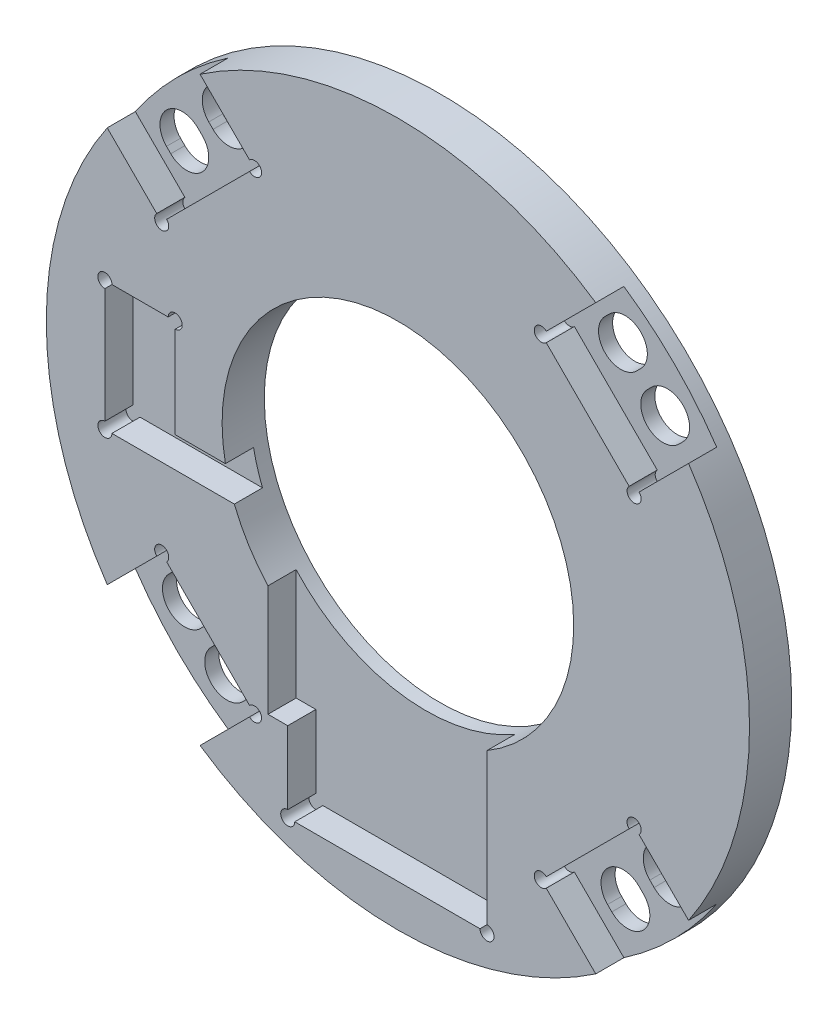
ISO-10303-21;
HEADER;
FILE_DESCRIPTION(('STEP AP214'),'2;1');
FILE_NAME('part.step','',(''),(''),'','','');
FILE_SCHEMA(('AUTOMOTIVE_DESIGN { 1 0 10303 214 1 1 1 1 }'));
ENDSEC;
DATA;
#1=APPLICATION_CONTEXT('core data for automotive mechanical design processes');
#2=APPLICATION_PROTOCOL_DEFINITION('international standard','automotive_design',2000,#1);
#3=PRODUCT_CONTEXT('',#1,'mechanical');
#4=PRODUCT('Part','Part','',(#3));
#5=PRODUCT_RELATED_PRODUCT_CATEGORY('part','',(#4));
#6=PRODUCT_DEFINITION_FORMATION('','',#4);
#7=PRODUCT_DEFINITION_CONTEXT('part definition',#1,'design');
#8=PRODUCT_DEFINITION('design','',#6,#7);
#9=PRODUCT_DEFINITION_SHAPE('','',#8);
#10=(LENGTH_UNIT() NAMED_UNIT(*) SI_UNIT(.MILLI.,.METRE.));
#11=(NAMED_UNIT(*) PLANE_ANGLE_UNIT() SI_UNIT($,.RADIAN.));
#12=(NAMED_UNIT(*) SI_UNIT($,.STERADIAN.) SOLID_ANGLE_UNIT());
#13=UNCERTAINTY_MEASURE_WITH_UNIT(LENGTH_MEASURE(1.E-05),#10,'distance_accuracy_value','');
#14=(GEOMETRIC_REPRESENTATION_CONTEXT(3) GLOBAL_UNCERTAINTY_ASSIGNED_CONTEXT((#13)) GLOBAL_UNIT_ASSIGNED_CONTEXT((#10,
#11,#12)) REPRESENTATION_CONTEXT('',''));
#15=CARTESIAN_POINT('',(0.,0.,0.));
#16=DIRECTION('',(0.,0.,1.));
#17=DIRECTION('',(1.,0.,0.));
#18=AXIS2_PLACEMENT_3D('',#15,#16,#17);
#19=CARTESIAN_POINT('',(0.,0.,18.));
#20=DIRECTION('',(0.,0.,1.));
#21=DIRECTION('',(1.,0.,0.));
#22=AXIS2_PLACEMENT_3D('',#19,#20,#21);
#23=PLANE('',#22);
#24=CARTESIAN_POINT('',(61.1647365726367,100.762716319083,18.));
#25=DIRECTION('',(0.,0.,1.));
#26=DIRECTION('',(1.,0.,0.));
#27=AXIS2_PLACEMENT_3D('',#24,#25,#26);
#28=CIRCLE('',#27,3.00000000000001);
#29=CARTESIAN_POINT('',(63.2860569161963,102.884036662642,18.));
#30=VERTEX_POINT('',#29);
#31=CARTESIAN_POINT('',(63.2860569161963,98.6413959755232,18.));
#32=VERTEX_POINT('',#31);
#33=EDGE_CURVE('E1178',#30,#32,#28,.T.);
#34=ORIENTED_EDGE('',*,*,#33,.F.);
#35=DIRECTION('',(-0.70710678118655,-0.707106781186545,0.));
#36=VECTOR('',#35,1.);
#37=CARTESIAN_POINT('',(84.4692938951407,124.067273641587,18.));
#38=LINE('',#37,#36);
#39=CARTESIAN_POINT('',(84.4027375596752,124.000717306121,18.));
#40=VERTEX_POINT('',#39);
#41=EDGE_CURVE('E783',#40,#30,#38,.T.);
#42=ORIENTED_EDGE('',*,*,#41,.F.);
#43=CARTESIAN_POINT('',(0.,0.,18.));
#44=DIRECTION('',(0.,0.,1.));
#45=DIRECTION('',(1.,0.,0.));
#46=AXIS2_PLACEMENT_3D('',#43,#44,#45);
#47=CIRCLE('',#46,150.);
#48=CARTESIAN_POINT('',(-84.4027375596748,124.000717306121,18.));
#49=VERTEX_POINT('',#48);
#50=EDGE_CURVE('E890',#40,#49,#47,.T.);
#51=ORIENTED_EDGE('',*,*,#50,.T.);
#52=DIRECTION('',(-0.707106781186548,0.707106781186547,0.));
#53=VECTOR('',#52,1.);
#54=CARTESIAN_POINT('',(-61.1647365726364,100.762716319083,18.));
#55=LINE('',#54,#53);
#56=CARTESIAN_POINT('',(-63.286056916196,102.884036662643,18.));
#57=VERTEX_POINT('',#56);
#58=EDGE_CURVE('E865',#57,#49,#55,.T.);
#59=ORIENTED_EDGE('',*,*,#58,.F.);
#60=CARTESIAN_POINT('',(-61.1647365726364,100.762716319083,18.));
#61=DIRECTION('',(0.,0.,1.));
#62=DIRECTION('',(1.,0.,0.));
#63=AXIS2_PLACEMENT_3D('',#60,#61,#62);
#64=CIRCLE('',#63,3.);
#65=CARTESIAN_POINT('',(-63.286056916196,98.6413959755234,18.));
#66=VERTEX_POINT('',#65);
#67=EDGE_CURVE('E1174',#66,#57,#64,.T.);
#68=ORIENTED_EDGE('',*,*,#67,.F.);
#69=DIRECTION('',(0.707106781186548,0.707106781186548,0.));
#70=VECTOR('',#69,1.);
#71=CARTESIAN_POINT('',(-100.762716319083,61.1647365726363,18.));
#72=LINE('',#71,#70);
#73=CARTESIAN_POINT('',(-98.6413959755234,63.286056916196,18.));
#74=VERTEX_POINT('',#73);
#75=EDGE_CURVE('E861',#74,#66,#72,.T.);
#76=ORIENTED_EDGE('',*,*,#75,.F.);
#77=CARTESIAN_POINT('',(-100.762716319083,61.1647365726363,18.));
#78=DIRECTION('',(0.,0.,1.));
#79=DIRECTION('',(1.,0.,0.));
#80=AXIS2_PLACEMENT_3D('',#77,#78,#79);
#81=CIRCLE('',#80,3.00000000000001);
#82=CARTESIAN_POINT('',(-102.884036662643,63.286056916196,18.));
#83=VERTEX_POINT('',#82);
#84=EDGE_CURVE('E501',#83,#74,#81,.T.);
#85=ORIENTED_EDGE('',*,*,#84,.F.);
#86=DIRECTION('',(0.707106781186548,-0.707106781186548,0.));
#87=VECTOR('',#86,1.);
#88=CARTESIAN_POINT('',(-124.067273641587,84.4692938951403,18.));
#89=LINE('',#88,#87);
#90=CARTESIAN_POINT('',(-124.000717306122,84.4027375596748,18.));
#91=VERTEX_POINT('',#90);
#92=EDGE_CURVE('E864',#91,#83,#89,.T.);
#93=ORIENTED_EDGE('',*,*,#92,.F.);
#94=CARTESIAN_POINT('',(-124.000717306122,-84.4027375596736,18.));
#95=VERTEX_POINT('',#94);
#96=EDGE_CURVE('E885',#91,#95,#47,.T.);
#97=ORIENTED_EDGE('',*,*,#96,.T.);
#98=DIRECTION('',(-0.707106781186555,-0.70710678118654,0.));
#99=VECTOR('',#98,1.);
#100=CARTESIAN_POINT('',(-100.762716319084,-61.1647365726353,18.));
#101=LINE('',#100,#99);
#102=CARTESIAN_POINT('',(-102.884036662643,-63.2860569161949,18.));
#103=VERTEX_POINT('',#102);
#104=EDGE_CURVE('E747',#103,#95,#101,.T.);
#105=ORIENTED_EDGE('',*,*,#104,.F.);
#106=CARTESIAN_POINT('',(-100.762716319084,-61.1647365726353,18.));
#107=DIRECTION('',(0.,0.,1.));
#108=DIRECTION('',(1.,0.,0.));
#109=AXIS2_PLACEMENT_3D('',#106,#107,#108);
#110=CIRCLE('',#109,3.00000000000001);
#111=CARTESIAN_POINT('',(-98.641395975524,-63.286056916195,18.));
#112=VERTEX_POINT('',#111);
#113=EDGE_CURVE('E1093',#112,#103,#110,.T.);
#114=ORIENTED_EDGE('',*,*,#113,.F.);
#115=DIRECTION('',(-0.70710678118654,0.707106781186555,0.));
#116=VECTOR('',#115,1.);
#117=CARTESIAN_POINT('',(-61.1647365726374,-100.762716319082,18.));
#118=LINE('',#117,#116);
#119=CARTESIAN_POINT('',(-63.286056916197,-98.6413959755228,18.));
#120=VERTEX_POINT('',#119);
#121=EDGE_CURVE('E743',#120,#112,#118,.T.);
#122=ORIENTED_EDGE('',*,*,#121,.F.);
#123=CARTESIAN_POINT('',(-61.1647365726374,-100.762716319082,18.));
#124=DIRECTION('',(0.,0.,1.));
#125=DIRECTION('',(1.,0.,0.));
#126=AXIS2_PLACEMENT_3D('',#123,#124,#125);
#127=CIRCLE('',#126,3.);
#128=CARTESIAN_POINT('',(-63.2860569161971,-102.884036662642,18.));
#129=VERTEX_POINT('',#128);
#130=EDGE_CURVE('E993',#129,#120,#127,.T.);
#131=ORIENTED_EDGE('',*,*,#130,.F.);
#132=DIRECTION('',(0.707106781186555,0.70710678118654,0.));
#133=VECTOR('',#132,1.);
#134=CARTESIAN_POINT('',(-84.4692938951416,-124.067273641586,18.));
#135=LINE('',#134,#133);
#136=CARTESIAN_POINT('',(-84.4027375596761,-124.000717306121,18.));
#137=VERTEX_POINT('',#136);
#138=EDGE_CURVE('E746',#137,#129,#135,.T.);
#139=ORIENTED_EDGE('',*,*,#138,.F.);
#140=CARTESIAN_POINT('',(84.4027375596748,-124.000717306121,18.));
#141=VERTEX_POINT('',#140);
#142=EDGE_CURVE('E889',#137,#141,#47,.T.);
#143=ORIENTED_EDGE('',*,*,#142,.T.);
#144=DIRECTION('',(0.707106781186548,-0.707106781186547,0.));
#145=VECTOR('',#144,1.);
#146=CARTESIAN_POINT('',(61.1647365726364,-100.762716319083,18.));
#147=LINE('',#146,#145);
#148=CARTESIAN_POINT('',(63.286056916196,-102.884036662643,18.));
#149=VERTEX_POINT('',#148);
#150=EDGE_CURVE('E766',#149,#141,#147,.T.);
#151=ORIENTED_EDGE('',*,*,#150,.F.);
#152=CARTESIAN_POINT('',(61.1647365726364,-100.762716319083,18.));
#153=DIRECTION('',(0.,0.,1.));
#154=DIRECTION('',(1.,0.,0.));
#155=AXIS2_PLACEMENT_3D('',#152,#153,#154);
#156=CIRCLE('',#155,3.00000000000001);
#157=CARTESIAN_POINT('',(63.286056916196,-98.6413959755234,18.));
#158=VERTEX_POINT('',#157);
#159=EDGE_CURVE('E1003',#158,#149,#156,.T.);
#160=ORIENTED_EDGE('',*,*,#159,.F.);
#161=DIRECTION('',(-0.707106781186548,-0.707106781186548,0.));
#162=VECTOR('',#161,1.);
#163=CARTESIAN_POINT('',(100.762716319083,-61.1647365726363,18.));
#164=LINE('',#163,#162);
#165=CARTESIAN_POINT('',(98.6413959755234,-63.286056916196,18.));
#166=VERTEX_POINT('',#165);
#167=EDGE_CURVE('E762',#166,#158,#164,.T.);
#168=ORIENTED_EDGE('',*,*,#167,.F.);
#169=CARTESIAN_POINT('',(100.762716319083,-61.1647365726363,18.));
#170=DIRECTION('',(0.,0.,1.));
#171=DIRECTION('',(1.,0.,0.));
#172=AXIS2_PLACEMENT_3D('',#169,#170,#171);
#173=CIRCLE('',#172,3.00000000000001);
#174=CARTESIAN_POINT('',(102.884036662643,-63.286056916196,18.));
#175=VERTEX_POINT('',#174);
#176=EDGE_CURVE('E1007',#175,#166,#173,.T.);
#177=ORIENTED_EDGE('',*,*,#176,.F.);
#178=DIRECTION('',(-0.707106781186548,0.707106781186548,0.));
#179=VECTOR('',#178,1.);
#180=CARTESIAN_POINT('',(124.067273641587,-84.4692938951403,18.));
#181=LINE('',#180,#179);
#182=CARTESIAN_POINT('',(124.000717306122,-84.4027375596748,18.));
#183=VERTEX_POINT('',#182);
#184=EDGE_CURVE('E765',#183,#175,#181,.T.);
#185=ORIENTED_EDGE('',*,*,#184,.F.);
#186=CARTESIAN_POINT('',(124.000717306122,84.4027375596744,18.));
#187=VERTEX_POINT('',#186);
#188=EDGE_CURVE('E1131',#183,#187,#47,.T.);
#189=ORIENTED_EDGE('',*,*,#188,.T.);
#190=DIRECTION('',(0.70710678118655,0.707106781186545,0.));
#191=VECTOR('',#190,1.);
#192=CARTESIAN_POINT('',(100.762716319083,61.164736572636,18.));
#193=LINE('',#192,#191);
#194=CARTESIAN_POINT('',(102.884036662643,63.2860569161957,18.));
#195=VERTEX_POINT('',#194);
#196=EDGE_CURVE('E784',#195,#187,#193,.T.);
#197=ORIENTED_EDGE('',*,*,#196,.F.);
#198=CARTESIAN_POINT('',(100.762716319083,61.164736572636,18.));
#199=DIRECTION('',(0.,0.,1.));
#200=DIRECTION('',(1.,0.,0.));
#201=AXIS2_PLACEMENT_3D('',#198,#199,#200);
#202=CIRCLE('',#201,3.00000000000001);
#203=CARTESIAN_POINT('',(98.6413959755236,63.2860569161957,18.));
#204=VERTEX_POINT('',#203);
#205=EDGE_CURVE('E1060',#204,#195,#202,.T.);
#206=ORIENTED_EDGE('',*,*,#205,.F.);
#207=DIRECTION('',(0.707106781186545,-0.70710678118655,0.));
#208=VECTOR('',#207,1.);
#209=CARTESIAN_POINT('',(61.1647365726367,100.762716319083,18.));
#210=LINE('',#209,#208);
#211=EDGE_CURVE('E781',#32,#204,#210,.T.);
#212=ORIENTED_EDGE('',*,*,#211,.F.);
#213=EDGE_LOOP('',(#34,#42,#51,#59,#68,#76,#85,#93,#97,#105,#114,#122,#131,#139,#143,#151,#160,
#168,#177,#185,#189,#197,#206,#212));
#214=FACE_BOUND('',#213,.T.);
#215=CARTESIAN_POINT('',(-125.0047364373,-27.5,18.));
#216=DIRECTION('',(0.,0.,1.));
#217=DIRECTION('',(1.,0.,0.));
#218=AXIS2_PLACEMENT_3D('',#215,#216,#217);
#219=CIRCLE('',#218,3.00000000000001);
#220=CARTESIAN_POINT('',(-125.0047364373,-24.5,18.));
#221=VERTEX_POINT('',#220);
#222=CARTESIAN_POINT('',(-122.0047364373,-27.5,18.));
#223=VERTEX_POINT('',#222);
#224=EDGE_CURVE('E1084',#221,#223,#219,.T.);
#225=ORIENTED_EDGE('',*,*,#224,.F.);
#226=DIRECTION('',(0.,-1.,0.));
#227=VECTOR('',#226,1.);
#228=CARTESIAN_POINT('',(-125.0047364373,27.5,18.));
#229=LINE('',#228,#227);
#230=CARTESIAN_POINT('',(-125.0047364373,24.5,18.));
#231=VERTEX_POINT('',#230);
#232=EDGE_CURVE('E527',#231,#221,#229,.T.);
#233=ORIENTED_EDGE('',*,*,#232,.F.);
#234=CARTESIAN_POINT('',(-125.0047364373,27.5,18.));
#235=DIRECTION('',(0.,0.,1.));
#236=DIRECTION('',(1.,0.,0.));
#237=AXIS2_PLACEMENT_3D('',#234,#235,#236);
#238=CIRCLE('',#237,3.00000000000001);
#239=CARTESIAN_POINT('',(-122.0047364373,27.5,18.));
#240=VERTEX_POINT('',#239);
#241=EDGE_CURVE('E502',#240,#231,#238,.T.);
#242=ORIENTED_EDGE('',*,*,#241,.F.);
#243=DIRECTION('',(-1.,0.,0.));
#244=VECTOR('',#243,1.);
#245=CARTESIAN_POINT('',(-125.0047364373,27.5,18.));
#246=LINE('',#245,#244);
#247=CARTESIAN_POINT('',(-98.0047364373,27.5,18.));
#248=VERTEX_POINT('',#247);
#249=EDGE_CURVE('E511',#248,#240,#246,.T.);
#250=ORIENTED_EDGE('',*,*,#249,.F.);
#251=CARTESIAN_POINT('',(-95.0047364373,27.5,18.));
#252=DIRECTION('',(0.,0.,1.));
#253=DIRECTION('',(1.,0.,0.));
#254=AXIS2_PLACEMENT_3D('',#251,#252,#253);
#255=CIRCLE('',#254,3.00000000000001);
#256=CARTESIAN_POINT('',(-95.0047364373,24.5,18.));
#257=VERTEX_POINT('',#256);
#258=EDGE_CURVE('E1080',#257,#248,#255,.T.);
#259=ORIENTED_EDGE('',*,*,#258,.F.);
#260=DIRECTION('',(0.,1.,0.));
#261=VECTOR('',#260,1.);
#262=CARTESIAN_POINT('',(-95.0047364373,27.5,18.));
#263=LINE('',#262,#261);
#264=CARTESIAN_POINT('',(-95.0047364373,-14.4813079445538,18.));
#265=VERTEX_POINT('',#264);
#266=EDGE_CURVE('E533',#265,#257,#263,.T.);
#267=ORIENTED_EDGE('',*,*,#266,.F.);
#268=DIRECTION('',(-1.,0.,0.));
#269=VECTOR('',#268,1.);
#270=CARTESIAN_POINT('',(-95.0047364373,-14.4813079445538,18.));
#271=LINE('',#270,#269);
#272=CARTESIAN_POINT('',(-73.5886657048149,-14.4813079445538,18.));
#273=VERTEX_POINT('',#272);
#274=EDGE_CURVE('E1070',#273,#265,#271,.T.);
#275=ORIENTED_EDGE('',*,*,#274,.F.);
#276=CARTESIAN_POINT('',(0.,0.,18.));
#277=DIRECTION('',(0.,0.,1.));
#278=DIRECTION('',(1.,0.,0.));
#279=AXIS2_PLACEMENT_3D('',#276,#277,#278);
#280=CIRCLE('',#279,75.);
#281=CARTESIAN_POINT('',(38.,-64.6606526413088,18.));
#282=VERTEX_POINT('',#281);
#283=EDGE_CURVE('E878',#282,#273,#280,.T.);
#284=ORIENTED_EDGE('',*,*,#283,.F.);
#285=DIRECTION('',(0.,1.,0.));
#286=VECTOR('',#285,1.);
#287=CARTESIAN_POINT('',(38.,-132.,18.));
#288=LINE('',#287,#286);
#289=CARTESIAN_POINT('',(38.,-129.,18.));
#290=VERTEX_POINT('',#289);
#291=EDGE_CURVE('E542',#290,#282,#288,.T.);
#292=ORIENTED_EDGE('',*,*,#291,.F.);
#293=CARTESIAN_POINT('',(38.,-132.,18.));
#294=DIRECTION('',(0.,0.,1.));
#295=DIRECTION('',(1.,0.,0.));
#296=AXIS2_PLACEMENT_3D('',#293,#294,#295);
#297=CIRCLE('',#296,3.);
#298=CARTESIAN_POINT('',(35.,-132.,18.));
#299=VERTEX_POINT('',#298);
#300=EDGE_CURVE('E995',#299,#290,#297,.T.);
#301=ORIENTED_EDGE('',*,*,#300,.F.);
#302=DIRECTION('',(1.,0.,0.));
#303=VECTOR('',#302,1.);
#304=CARTESIAN_POINT('',(-47.,-132.,18.));
#305=LINE('',#304,#303);
#306=CARTESIAN_POINT('',(-44.,-132.,18.));
#307=VERTEX_POINT('',#306);
#308=EDGE_CURVE('E521',#307,#299,#305,.T.);
#309=ORIENTED_EDGE('',*,*,#308,.F.);
#310=CARTESIAN_POINT('',(-47.,-132.,18.));
#311=DIRECTION('',(0.,0.,1.));
#312=DIRECTION('',(1.,0.,0.));
#313=AXIS2_PLACEMENT_3D('',#310,#311,#312);
#314=CIRCLE('',#313,3.);
#315=CARTESIAN_POINT('',(-47.,-129.,18.));
#316=VERTEX_POINT('',#315);
#317=EDGE_CURVE('E985',#316,#307,#314,.T.);
#318=ORIENTED_EDGE('',*,*,#317,.F.);
#319=DIRECTION('',(0.,-1.,0.));
#320=VECTOR('',#319,1.);
#321=CARTESIAN_POINT('',(-47.,-132.,18.));
#322=LINE('',#321,#320);
#323=CARTESIAN_POINT('',(-47.,-97.9873555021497,18.));
#324=VERTEX_POINT('',#323);
#325=EDGE_CURVE('E517',#324,#316,#322,.T.);
#326=ORIENTED_EDGE('',*,*,#325,.F.);
#327=DIRECTION('',(1.,0.,0.));
#328=VECTOR('',#327,1.);
#329=CARTESIAN_POINT('',(-47.,-97.9873555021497,18.));
#330=LINE('',#329,#328);
#331=CARTESIAN_POINT('',(-55.4279681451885,-97.9873555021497,18.));
#332=VERTEX_POINT('',#331);
#333=EDGE_CURVE('E935',#332,#324,#330,.T.);
#334=ORIENTED_EDGE('',*,*,#333,.F.);
#335=DIRECTION('',(0.,-1.,0.));
#336=VECTOR('',#335,1.);
#337=CARTESIAN_POINT('',(-55.4279681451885,-97.9873555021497,18.));
#338=LINE('',#337,#336);
#339=CARTESIAN_POINT('',(-55.4279681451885,-50.5246508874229,18.));
#340=VERTEX_POINT('',#339);
#341=EDGE_CURVE('E959',#340,#332,#338,.T.);
#342=ORIENTED_EDGE('',*,*,#341,.F.);
#343=CARTESIAN_POINT('',(-69.7764286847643,-27.5,18.));
#344=VERTEX_POINT('',#343);
#345=EDGE_CURVE('E882',#344,#340,#280,.T.);
#346=ORIENTED_EDGE('',*,*,#345,.F.);
#347=DIRECTION('',(1.,0.,0.));
#348=VECTOR('',#347,1.);
#349=CARTESIAN_POINT('',(-125.0047364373,-27.5,18.));
#350=LINE('',#349,#348);
#351=EDGE_CURVE('E530',#223,#344,#350,.T.);
#352=ORIENTED_EDGE('',*,*,#351,.F.);
#353=EDGE_LOOP('',(#225,#233,#242,#250,#259,#267,#275,#284,#292,#301,#309,#318,#326,#334,#342,
#346,#352));
#354=FACE_BOUND('',#353,.T.);
#355=ADVANCED_FACE('F35',(#214,#354),#23,.T.);
#356=CARTESIAN_POINT('',(0.,0.,18.));
#357=DIRECTION('',(0.,0.,-1.));
#358=DIRECTION('',(-1.,0.,0.));
#359=AXIS2_PLACEMENT_3D('',#356,#357,#358);
#360=CYLINDRICAL_SURFACE('',#359,150.);
#361=CARTESIAN_POINT('',(0.,0.,0.));
#362=DIRECTION('',(0.,0.,1.));
#363=DIRECTION('',(1.,0.,0.));
#364=AXIS2_PLACEMENT_3D('',#361,#362,#363);
#365=CIRCLE('',#364,150.);
#366=CARTESIAN_POINT('',(150.,0.,0.));
#367=VERTEX_POINT('',#366);
#368=EDGE_CURVE('E881',#367,#367,#365,.T.);
#369=ORIENTED_EDGE('',*,*,#368,.T.);
#370=EDGE_LOOP('',(#369));
#371=FACE_BOUND('',#370,.T.);
#372=DIRECTION('',(0.,0.,-1.));
#373=VECTOR('',#372,1.);
#374=CARTESIAN_POINT('',(-124.000717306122,-84.4027375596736,18.));
#375=LINE('',#374,#373);
#376=CARTESIAN_POINT('',(-124.000717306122,-84.4027375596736,6.));
#377=VERTEX_POINT('',#376);
#378=EDGE_CURVE('E913',#95,#377,#375,.T.);
#379=ORIENTED_EDGE('',*,*,#378,.F.);
#380=ORIENTED_EDGE('',*,*,#96,.F.);
#381=DIRECTION('',(0.,0.,-1.));
#382=VECTOR('',#381,1.);
#383=CARTESIAN_POINT('',(-124.000717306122,84.4027375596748,18.));
#384=LINE('',#383,#382);
#385=CARTESIAN_POINT('',(-124.000717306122,84.4027375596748,6.));
#386=VERTEX_POINT('',#385);
#387=EDGE_CURVE('E888',#386,#91,#384,.F.);
#388=ORIENTED_EDGE('',*,*,#387,.F.);
#389=CARTESIAN_POINT('',(0.,0.,6.));
#390=DIRECTION('',(0.,0.,1.));
#391=DIRECTION('',(1.,0.,0.));
#392=AXIS2_PLACEMENT_3D('',#389,#390,#391);
#393=CIRCLE('',#392,150.);
#394=CARTESIAN_POINT('',(-84.4027375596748,124.000717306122,6.));
#395=VERTEX_POINT('',#394);
#396=EDGE_CURVE('E854',#395,#386,#393,.T.);
#397=ORIENTED_EDGE('',*,*,#396,.F.);
#398=DIRECTION('',(0.,0.,-1.));
#399=VECTOR('',#398,1.);
#400=CARTESIAN_POINT('',(-84.4027375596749,124.000717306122,18.));
#401=LINE('',#400,#399);
#402=EDGE_CURVE('E895',#49,#395,#401,.T.);
#403=ORIENTED_EDGE('',*,*,#402,.F.);
#404=ORIENTED_EDGE('',*,*,#50,.F.);
#405=DIRECTION('',(0.,0.,-1.));
#406=VECTOR('',#405,1.);
#407=CARTESIAN_POINT('',(84.4027375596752,124.000717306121,18.));
#408=LINE('',#407,#406);
#409=CARTESIAN_POINT('',(84.4027375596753,124.000717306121,6.));
#410=VERTEX_POINT('',#409);
#411=EDGE_CURVE('E898',#410,#40,#408,.F.);
#412=ORIENTED_EDGE('',*,*,#411,.F.);
#413=CARTESIAN_POINT('',(0.,0.,6.));
#414=DIRECTION('',(0.,0.,1.));
#415=DIRECTION('',(1.,0.,0.));
#416=AXIS2_PLACEMENT_3D('',#413,#414,#415);
#417=CIRCLE('',#416,150.);
#418=CARTESIAN_POINT('',(124.000717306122,84.4027375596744,6.));
#419=VERTEX_POINT('',#418);
#420=EDGE_CURVE('E769',#419,#410,#417,.T.);
#421=ORIENTED_EDGE('',*,*,#420,.F.);
#422=DIRECTION('',(0.,0.,-1.));
#423=VECTOR('',#422,1.);
#424=CARTESIAN_POINT('',(124.000717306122,84.4027375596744,18.));
#425=LINE('',#424,#423);
#426=EDGE_CURVE('E901',#187,#419,#425,.T.);
#427=ORIENTED_EDGE('',*,*,#426,.F.);
#428=ORIENTED_EDGE('',*,*,#188,.F.);
#429=DIRECTION('',(0.,0.,-1.));
#430=VECTOR('',#429,1.);
#431=CARTESIAN_POINT('',(124.000717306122,-84.4027375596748,18.));
#432=LINE('',#431,#430);
#433=CARTESIAN_POINT('',(124.000717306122,-84.4027375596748,6.));
#434=VERTEX_POINT('',#433);
#435=EDGE_CURVE('E904',#434,#183,#432,.F.);
#436=ORIENTED_EDGE('',*,*,#435,.F.);
#437=CARTESIAN_POINT('',(0.,0.,6.));
#438=DIRECTION('',(0.,0.,1.));
#439=DIRECTION('',(1.,0.,0.));
#440=AXIS2_PLACEMENT_3D('',#437,#438,#439);
#441=CIRCLE('',#440,150.);
#442=CARTESIAN_POINT('',(84.4027375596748,-124.000717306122,6.));
#443=VERTEX_POINT('',#442);
#444=EDGE_CURVE('E750',#443,#434,#441,.T.);
#445=ORIENTED_EDGE('',*,*,#444,.F.);
#446=DIRECTION('',(0.,0.,-1.));
#447=VECTOR('',#446,1.);
#448=CARTESIAN_POINT('',(84.4027375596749,-124.000717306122,18.));
#449=LINE('',#448,#447);
#450=EDGE_CURVE('E907',#141,#443,#449,.T.);
#451=ORIENTED_EDGE('',*,*,#450,.F.);
#452=ORIENTED_EDGE('',*,*,#142,.F.);
#453=DIRECTION('',(0.,0.,-1.));
#454=VECTOR('',#453,1.);
#455=CARTESIAN_POINT('',(-84.4027375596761,-124.000717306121,18.));
#456=LINE('',#455,#454);
#457=CARTESIAN_POINT('',(-84.4027375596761,-124.000717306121,6.));
#458=VERTEX_POINT('',#457);
#459=EDGE_CURVE('E910',#458,#137,#456,.F.);
#460=ORIENTED_EDGE('',*,*,#459,.F.);
#461=CARTESIAN_POINT('',(0.,0.,6.));
#462=DIRECTION('',(0.,0.,1.));
#463=DIRECTION('',(1.,0.,0.));
#464=AXIS2_PLACEMENT_3D('',#461,#462,#463);
#465=CIRCLE('',#464,150.);
#466=EDGE_CURVE('E736',#377,#458,#465,.T.);
#467=ORIENTED_EDGE('',*,*,#466,.F.);
#468=EDGE_LOOP('',(#379,#380,#388,#397,#403,#404,#412,#421,#427,#428,#436,#445,#451,#452,#460,#467));
#469=FACE_BOUND('',#468,.T.);
#470=ADVANCED_FACE('F37',(#371,#469),#360,.T.);
#471=CARTESIAN_POINT('',(0.,0.,0.));
#472=DIRECTION('',(0.,0.,1.));
#473=DIRECTION('',(1.,0.,0.));
#474=AXIS2_PLACEMENT_3D('',#471,#472,#473);
#475=PLANE('',#474);
#476=DIRECTION('',(-0.707106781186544,-0.707106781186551,0.));
#477=VECTOR('',#476,1.);
#478=CARTESIAN_POINT('',(-91.6288953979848,-97.2857496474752,0.));
#479=LINE('',#478,#477);
#480=CARTESIAN_POINT('',(-89.8025612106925,-95.459415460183,0.));
#481=VERTEX_POINT('',#480);
#482=CARTESIAN_POINT('',(-91.6288953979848,-97.2857496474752,0.));
#483=VERTEX_POINT('',#482);
#484=EDGE_CURVE('E627',#481,#483,#479,.T.);
#485=ORIENTED_EDGE('',*,*,#484,.T.);
#486=CARTESIAN_POINT('',(-84.9113809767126,-104.003264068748,0.));
#487=DIRECTION('',(0.,0.,1.));
#488=DIRECTION('',(0.,1.,0.));
#489=AXIS2_PLACEMENT_3D('',#486,#487,#488);
#490=CIRCLE('',#489,9.5);
#491=CARTESIAN_POINT('',(-78.1938665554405,-110.72077849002,0.));
#492=VERTEX_POINT('',#491);
#493=EDGE_CURVE('E617',#483,#492,#490,.T.);
#494=ORIENTED_EDGE('',*,*,#493,.T.);
#495=DIRECTION('',(0.707106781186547,0.707106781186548,0.));
#496=VECTOR('',#495,1.);
#497=CARTESIAN_POINT('',(-78.1938665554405,-110.72077849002,0.));
#498=LINE('',#497,#496);
#499=CARTESIAN_POINT('',(-76.3675323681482,-108.894444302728,0.));
#500=VERTEX_POINT('',#499);
#501=EDGE_CURVE('E620',#492,#500,#498,.T.);
#502=ORIENTED_EDGE('',*,*,#501,.T.);
#503=CARTESIAN_POINT('',(-83.0850467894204,-102.176929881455,0.));
#504=DIRECTION('',(0.,0.,1.));
#505=DIRECTION('',(0.,1.,0.));
#506=AXIS2_PLACEMENT_3D('',#503,#504,#505);
#507=CIRCLE('',#506,9.5);
#508=EDGE_CURVE('E624',#500,#481,#507,.T.);
#509=ORIENTED_EDGE('',*,*,#508,.T.);
#510=EDGE_LOOP('',(#485,#494,#502,#509));
#511=FACE_BOUND('',#510,.T.);
#512=DIRECTION('',(-0.707106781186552,-0.707106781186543,0.));
#513=VECTOR('',#512,1.);
#514=CARTESIAN_POINT('',(-109.660118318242,-79.2545267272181,0.));
#515=LINE('',#514,#513);
#516=CARTESIAN_POINT('',(-107.833784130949,-77.4281925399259,0.));
#517=VERTEX_POINT('',#516);
#518=CARTESIAN_POINT('',(-109.660118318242,-79.2545267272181,0.));
#519=VERTEX_POINT('',#518);
#520=EDGE_CURVE('E595',#517,#519,#515,.T.);
#521=ORIENTED_EDGE('',*,*,#520,.T.);
#522=CARTESIAN_POINT('',(-102.942603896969,-85.9720411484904,0.));
#523=DIRECTION('',(0.,0.,1.));
#524=DIRECTION('',(0.,1.,0.));
#525=AXIS2_PLACEMENT_3D('',#522,#523,#524);
#526=CIRCLE('',#525,9.5);
#527=CARTESIAN_POINT('',(-96.2250894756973,-92.6895555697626,0.));
#528=VERTEX_POINT('',#527);
#529=EDGE_CURVE('E585',#519,#528,#526,.T.);
#530=ORIENTED_EDGE('',*,*,#529,.T.);
#531=DIRECTION('',(0.707106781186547,0.707106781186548,0.));
#532=VECTOR('',#531,1.);
#533=CARTESIAN_POINT('',(-96.2250894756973,-92.6895555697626,0.));
#534=LINE('',#533,#532);
#535=CARTESIAN_POINT('',(-94.3987552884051,-90.8632213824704,0.));
#536=VERTEX_POINT('',#535);
#537=EDGE_CURVE('E588',#528,#536,#534,.T.);
#538=ORIENTED_EDGE('',*,*,#537,.T.);
#539=CARTESIAN_POINT('',(-101.116269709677,-84.1457069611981,0.));
#540=DIRECTION('',(0.,0.,1.));
#541=DIRECTION('',(0.,1.,0.));
#542=AXIS2_PLACEMENT_3D('',#539,#540,#541);
#543=CIRCLE('',#542,9.49999999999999);
#544=EDGE_CURVE('E592',#536,#517,#543,.T.);
#545=ORIENTED_EDGE('',*,*,#544,.T.);
#546=EDGE_LOOP('',(#521,#530,#538,#545));
#547=FACE_BOUND('',#546,.T.);
#548=DIRECTION('',(0.70710678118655,-0.707106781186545,0.));
#549=VECTOR('',#548,1.);
#550=CARTESIAN_POINT('',(79.2545267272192,-109.660118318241,0.));
#551=LINE('',#550,#549);
#552=CARTESIAN_POINT('',(77.428192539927,-107.833784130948,0.));
#553=VERTEX_POINT('',#552);
#554=CARTESIAN_POINT('',(79.2545267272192,-109.660118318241,0.));
#555=VERTEX_POINT('',#554);
#556=EDGE_CURVE('E561',#553,#555,#551,.T.);
#557=ORIENTED_EDGE('',*,*,#556,.T.);
#558=CARTESIAN_POINT('',(85.9720411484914,-102.942603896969,0.));
#559=DIRECTION('',(0.,0.,1.));
#560=DIRECTION('',(-1.,0.,0.));
#561=AXIS2_PLACEMENT_3D('',#558,#559,#560);
#562=CIRCLE('',#561,9.5);
#563=CARTESIAN_POINT('',(92.6895555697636,-96.2250894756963,0.));
#564=VERTEX_POINT('',#563);
#565=EDGE_CURVE('E551',#555,#564,#562,.T.);
#566=ORIENTED_EDGE('',*,*,#565,.T.);
#567=DIRECTION('',(-0.707106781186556,0.707106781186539,0.));
#568=VECTOR('',#567,1.);
#569=CARTESIAN_POINT('',(92.6895555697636,-96.2250894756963,0.));
#570=LINE('',#569,#568);
#571=CARTESIAN_POINT('',(90.8632213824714,-94.3987552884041,0.));
#572=VERTEX_POINT('',#571);
#573=EDGE_CURVE('E554',#564,#572,#570,.T.);
#574=ORIENTED_EDGE('',*,*,#573,.T.);
#575=CARTESIAN_POINT('',(84.1457069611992,-101.116269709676,0.));
#576=DIRECTION('',(0.,0.,1.));
#577=DIRECTION('',(-1.,0.,0.));
#578=AXIS2_PLACEMENT_3D('',#575,#576,#577);
#579=CIRCLE('',#578,9.49999999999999);
#580=EDGE_CURVE('E558',#572,#553,#579,.T.);
#581=ORIENTED_EDGE('',*,*,#580,.T.);
#582=EDGE_LOOP('',(#557,#566,#574,#581));
#583=FACE_BOUND('',#582,.T.);
#584=DIRECTION('',(0.707106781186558,-0.707106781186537,0.));
#585=VECTOR('',#584,1.);
#586=CARTESIAN_POINT('',(97.2857496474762,-91.6288953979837,0.));
#587=LINE('',#586,#585);
#588=CARTESIAN_POINT('',(95.4594154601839,-89.8025612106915,0.));
#589=VERTEX_POINT('',#588);
#590=CARTESIAN_POINT('',(97.2857496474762,-91.6288953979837,0.));
#591=VERTEX_POINT('',#590);
#592=EDGE_CURVE('E691',#589,#591,#587,.T.);
#593=ORIENTED_EDGE('',*,*,#592,.T.);
#594=CARTESIAN_POINT('',(104.003264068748,-84.9113809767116,0.));
#595=DIRECTION('',(0.,0.,1.));
#596=DIRECTION('',(-1.,0.,0.));
#597=AXIS2_PLACEMENT_3D('',#594,#595,#596);
#598=CIRCLE('',#597,9.5);
#599=CARTESIAN_POINT('',(110.720778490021,-78.1938665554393,0.));
#600=VERTEX_POINT('',#599);
#601=EDGE_CURVE('E681',#591,#600,#598,.T.);
#602=ORIENTED_EDGE('',*,*,#601,.T.);
#603=DIRECTION('',(-0.707106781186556,0.707106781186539,0.));
#604=VECTOR('',#603,1.);
#605=CARTESIAN_POINT('',(110.720778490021,-78.1938665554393,0.));
#606=LINE('',#605,#604);
#607=CARTESIAN_POINT('',(108.894444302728,-76.3675323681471,0.));
#608=VERTEX_POINT('',#607);
#609=EDGE_CURVE('E684',#600,#608,#606,.T.);
#610=ORIENTED_EDGE('',*,*,#609,.T.);
#611=CARTESIAN_POINT('',(102.176929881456,-83.0850467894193,0.));
#612=DIRECTION('',(0.,0.,1.));
#613=DIRECTION('',(-1.,0.,0.));
#614=AXIS2_PLACEMENT_3D('',#611,#612,#613);
#615=CIRCLE('',#614,9.5);
#616=EDGE_CURVE('E688',#608,#589,#615,.T.);
#617=ORIENTED_EDGE('',*,*,#616,.T.);
#618=EDGE_LOOP('',(#593,#602,#610,#617));
#619=FACE_BOUND('',#618,.T.);
#620=DIRECTION('',(0.707106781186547,0.707106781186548,0.));
#621=VECTOR('',#620,1.);
#622=CARTESIAN_POINT('',(109.660118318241,79.2545267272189,0.));
#623=LINE('',#622,#621);
#624=CARTESIAN_POINT('',(107.833784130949,77.4281925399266,0.));
#625=VERTEX_POINT('',#624);
#626=CARTESIAN_POINT('',(109.660118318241,79.2545267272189,0.));
#627=VERTEX_POINT('',#626);
#628=EDGE_CURVE('E657',#625,#627,#623,.T.);
#629=ORIENTED_EDGE('',*,*,#628,.T.);
#630=CARTESIAN_POINT('',(102.942603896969,85.9720411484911,0.));
#631=DIRECTION('',(0.,0.,1.));
#632=DIRECTION('',(0.,-1.,0.));
#633=AXIS2_PLACEMENT_3D('',#630,#631,#632);
#634=CIRCLE('',#633,9.5);
#635=CARTESIAN_POINT('',(96.2250894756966,92.6895555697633,0.));
#636=VERTEX_POINT('',#635);
#637=EDGE_CURVE('E647',#627,#636,#634,.T.);
#638=ORIENTED_EDGE('',*,*,#637,.T.);
#639=DIRECTION('',(-0.707106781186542,-0.707106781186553,0.));
#640=VECTOR('',#639,1.);
#641=CARTESIAN_POINT('',(96.2250894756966,92.6895555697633,0.));
#642=LINE('',#641,#640);
#643=CARTESIAN_POINT('',(94.3987552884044,90.8632213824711,0.));
#644=VERTEX_POINT('',#643);
#645=EDGE_CURVE('E650',#636,#644,#642,.T.);
#646=ORIENTED_EDGE('',*,*,#645,.T.);
#647=CARTESIAN_POINT('',(101.116269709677,84.1457069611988,0.));
#648=DIRECTION('',(0.,0.,1.));
#649=DIRECTION('',(0.,-1.,0.));
#650=AXIS2_PLACEMENT_3D('',#647,#648,#649);
#651=CIRCLE('',#650,9.49999999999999);
#652=EDGE_CURVE('E654',#644,#625,#651,.T.);
#653=ORIENTED_EDGE('',*,*,#652,.T.);
#654=EDGE_LOOP('',(#629,#638,#646,#653));
#655=FACE_BOUND('',#654,.T.);
#656=DIRECTION('',(0.707106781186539,0.707106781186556,0.));
#657=VECTOR('',#656,1.);
#658=CARTESIAN_POINT('',(91.6288953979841,97.2857496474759,0.));
#659=LINE('',#658,#657);
#660=CARTESIAN_POINT('',(89.8025612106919,95.4594154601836,0.));
#661=VERTEX_POINT('',#660);
#662=CARTESIAN_POINT('',(91.6288953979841,97.2857496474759,0.));
#663=VERTEX_POINT('',#662);
#664=EDGE_CURVE('E721',#661,#663,#659,.T.);
#665=ORIENTED_EDGE('',*,*,#664,.T.);
#666=CARTESIAN_POINT('',(84.9113809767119,104.003264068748,0.));
#667=DIRECTION('',(0.,0.,1.));
#668=DIRECTION('',(0.,-1.,0.));
#669=AXIS2_PLACEMENT_3D('',#666,#667,#668);
#670=CIRCLE('',#669,9.5);
#671=CARTESIAN_POINT('',(78.1938665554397,110.72077849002,0.));
#672=VERTEX_POINT('',#671);
#673=EDGE_CURVE('E711',#663,#672,#670,.T.);
#674=ORIENTED_EDGE('',*,*,#673,.T.);
#675=DIRECTION('',(-0.707106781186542,-0.707106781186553,0.));
#676=VECTOR('',#675,1.);
#677=CARTESIAN_POINT('',(78.1938665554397,110.72077849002,0.));
#678=LINE('',#677,#676);
#679=CARTESIAN_POINT('',(76.3675323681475,108.894444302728,0.));
#680=VERTEX_POINT('',#679);
#681=EDGE_CURVE('E714',#672,#680,#678,.T.);
#682=ORIENTED_EDGE('',*,*,#681,.T.);
#683=CARTESIAN_POINT('',(83.0850467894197,102.176929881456,0.));
#684=DIRECTION('',(0.,0.,1.));
#685=DIRECTION('',(0.,-1.,0.));
#686=AXIS2_PLACEMENT_3D('',#683,#684,#685);
#687=CIRCLE('',#686,9.5);
#688=EDGE_CURVE('E718',#680,#661,#687,.T.);
#689=ORIENTED_EDGE('',*,*,#688,.T.);
#690=EDGE_LOOP('',(#665,#674,#682,#689));
#691=FACE_BOUND('',#690,.T.);
#692=DIRECTION('',(-0.70710678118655,0.707106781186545,0.));
#693=VECTOR('',#692,1.);
#694=CARTESIAN_POINT('',(-79.2545267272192,109.660118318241,0.));
#695=LINE('',#694,#693);
#696=CARTESIAN_POINT('',(-77.428192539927,107.833784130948,0.));
#697=VERTEX_POINT('',#696);
#698=CARTESIAN_POINT('',(-79.2545267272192,109.660118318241,0.));
#699=VERTEX_POINT('',#698);
#700=EDGE_CURVE('E807',#697,#699,#695,.T.);
#701=ORIENTED_EDGE('',*,*,#700,.T.);
#702=CARTESIAN_POINT('',(-85.9720411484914,102.942603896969,0.));
#703=DIRECTION('',(0.,0.,1.));
#704=DIRECTION('',(1.,0.,0.));
#705=AXIS2_PLACEMENT_3D('',#702,#703,#704);
#706=CIRCLE('',#705,9.5);
#707=CARTESIAN_POINT('',(-92.6895555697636,96.2250894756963,0.));
#708=VERTEX_POINT('',#707);
#709=EDGE_CURVE('E797',#699,#708,#706,.T.);
#710=ORIENTED_EDGE('',*,*,#709,.T.);
#711=DIRECTION('',(0.707106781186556,-0.707106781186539,0.));
#712=VECTOR('',#711,1.);
#713=CARTESIAN_POINT('',(-92.6895555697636,96.2250894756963,0.));
#714=LINE('',#713,#712);
#715=CARTESIAN_POINT('',(-90.8632213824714,94.3987552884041,0.));
#716=VERTEX_POINT('',#715);
#717=EDGE_CURVE('E800',#708,#716,#714,.T.);
#718=ORIENTED_EDGE('',*,*,#717,.T.);
#719=CARTESIAN_POINT('',(-84.1457069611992,101.116269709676,0.));
#720=DIRECTION('',(0.,0.,1.));
#721=DIRECTION('',(1.,0.,0.));
#722=AXIS2_PLACEMENT_3D('',#719,#720,#721);
#723=CIRCLE('',#722,9.49999999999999);
#724=EDGE_CURVE('E804',#716,#697,#723,.T.);
#725=ORIENTED_EDGE('',*,*,#724,.T.);
#726=EDGE_LOOP('',(#701,#710,#718,#725));
#727=FACE_BOUND('',#726,.T.);
#728=DIRECTION('',(-0.707106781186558,0.707106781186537,0.));
#729=VECTOR('',#728,1.);
#730=CARTESIAN_POINT('',(-97.2857496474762,91.6288953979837,0.));
#731=LINE('',#730,#729);
#732=CARTESIAN_POINT('',(-95.4594154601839,89.8025612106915,0.));
#733=VERTEX_POINT('',#732);
#734=CARTESIAN_POINT('',(-97.2857496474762,91.6288953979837,0.));
#735=VERTEX_POINT('',#734);
#736=EDGE_CURVE('E839',#733,#735,#731,.T.);
#737=ORIENTED_EDGE('',*,*,#736,.T.);
#738=CARTESIAN_POINT('',(-104.003264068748,84.9113809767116,0.));
#739=DIRECTION('',(0.,0.,1.));
#740=DIRECTION('',(1.,0.,0.));
#741=AXIS2_PLACEMENT_3D('',#738,#739,#740);
#742=CIRCLE('',#741,9.5);
#743=CARTESIAN_POINT('',(-110.720778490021,78.1938665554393,0.));
#744=VERTEX_POINT('',#743);
#745=EDGE_CURVE('E829',#735,#744,#742,.T.);
#746=ORIENTED_EDGE('',*,*,#745,.T.);
#747=DIRECTION('',(0.707106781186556,-0.707106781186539,0.));
#748=VECTOR('',#747,1.);
#749=CARTESIAN_POINT('',(-110.720778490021,78.1938665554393,0.));
#750=LINE('',#749,#748);
#751=CARTESIAN_POINT('',(-108.894444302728,76.3675323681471,0.));
#752=VERTEX_POINT('',#751);
#753=EDGE_CURVE('E832',#744,#752,#750,.T.);
#754=ORIENTED_EDGE('',*,*,#753,.T.);
#755=CARTESIAN_POINT('',(-102.176929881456,83.0850467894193,0.));
#756=DIRECTION('',(0.,0.,1.));
#757=DIRECTION('',(1.,0.,0.));
#758=AXIS2_PLACEMENT_3D('',#755,#756,#757);
#759=CIRCLE('',#758,9.5);
#760=EDGE_CURVE('E836',#752,#733,#759,.T.);
#761=ORIENTED_EDGE('',*,*,#760,.T.);
#762=EDGE_LOOP('',(#737,#746,#754,#761));
#763=FACE_BOUND('',#762,.T.);
#764=ORIENTED_EDGE('',*,*,#368,.F.);
#765=EDGE_LOOP('',(#764));
#766=FACE_BOUND('',#765,.T.);
#767=CARTESIAN_POINT('',(0.,0.,0.));
#768=DIRECTION('',(0.,0.,1.));
#769=DIRECTION('',(1.,0.,0.));
#770=AXIS2_PLACEMENT_3D('',#767,#768,#769);
#771=CIRCLE('',#770,75.);
#772=CARTESIAN_POINT('',(75.,0.,0.));
#773=VERTEX_POINT('',#772);
#774=EDGE_CURVE('E868',#773,#773,#771,.T.);
#775=ORIENTED_EDGE('',*,*,#774,.T.);
#776=EDGE_LOOP('',(#775));
#777=FACE_BOUND('',#776,.T.);
#778=ADVANCED_FACE('F1209',(#511,#547,#583,#619,#655,#691,#727,#763,#766,#777),#475,.F.);
#779=CARTESIAN_POINT('',(0.,0.,18.));
#780=DIRECTION('',(0.,0.,-1.));
#781=DIRECTION('',(-1.,0.,0.));
#782=AXIS2_PLACEMENT_3D('',#779,#780,#781);
#783=CYLINDRICAL_SURFACE('',#782,75.);
#784=DIRECTION('',(0.,0.,-1.));
#785=VECTOR('',#784,1.);
#786=CARTESIAN_POINT('',(-69.7764286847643,-27.5,18.));
#787=LINE('',#786,#785);
#788=CARTESIAN_POINT('',(-69.7764286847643,-27.5,6.));
#789=VERTEX_POINT('',#788);
#790=EDGE_CURVE('E956',#344,#789,#787,.T.);
#791=ORIENTED_EDGE('',*,*,#790,.F.);
#792=ORIENTED_EDGE('',*,*,#345,.T.);
#793=DIRECTION('',(0.,0.,1.));
#794=VECTOR('',#793,1.);
#795=CARTESIAN_POINT('',(-55.4279681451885,-50.5246508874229,6.));
#796=LINE('',#795,#794);
#797=CARTESIAN_POINT('',(-55.4279681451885,-50.5246508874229,6.));
#798=VERTEX_POINT('',#797);
#799=EDGE_CURVE('E931',#798,#340,#796,.T.);
#800=ORIENTED_EDGE('',*,*,#799,.F.);
#801=CARTESIAN_POINT('',(0.,0.,6.));
#802=DIRECTION('',(0.,0.,-1.));
#803=DIRECTION('',(-1.,0.,0.));
#804=AXIS2_PLACEMENT_3D('',#801,#802,#803);
#805=CIRCLE('',#804,75.);
#806=CARTESIAN_POINT('',(38.,-64.6606526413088,6.));
#807=VERTEX_POINT('',#806);
#808=EDGE_CURVE('E43',#807,#798,#805,.T.);
#809=ORIENTED_EDGE('',*,*,#808,.F.);
#810=DIRECTION('',(0.,0.,-1.));
#811=VECTOR('',#810,1.);
#812=CARTESIAN_POINT('',(38.,-64.6606526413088,18.));
#813=LINE('',#812,#811);
#814=EDGE_CURVE('E11',#282,#807,#813,.T.);
#815=ORIENTED_EDGE('',*,*,#814,.F.);
#816=ORIENTED_EDGE('',*,*,#283,.T.);
#817=DIRECTION('',(0.,0.,-1.));
#818=VECTOR('',#817,1.);
#819=CARTESIAN_POINT('',(-73.5886657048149,-14.4813079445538,18.));
#820=LINE('',#819,#818);
#821=CARTESIAN_POINT('',(-73.5886657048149,-14.4813079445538,6.));
#822=VERTEX_POINT('',#821);
#823=EDGE_CURVE('E960',#822,#273,#820,.F.);
#824=ORIENTED_EDGE('',*,*,#823,.F.);
#825=CARTESIAN_POINT('',(0.,0.,6.));
#826=DIRECTION('',(0.,0.,-1.));
#827=DIRECTION('',(-1.,0.,0.));
#828=AXIS2_PLACEMENT_3D('',#825,#826,#827);
#829=CIRCLE('',#828,75.);
#830=EDGE_CURVE('E950',#789,#822,#829,.T.);
#831=ORIENTED_EDGE('',*,*,#830,.F.);
#832=EDGE_LOOP('',(#791,#792,#800,#809,#815,#816,#824,#831));
#833=FACE_BOUND('',#832,.T.);
#834=ORIENTED_EDGE('',*,*,#774,.F.);
#835=EDGE_LOOP('',(#834));
#836=FACE_BOUND('',#835,.T.);
#837=ADVANCED_FACE('F938',(#833,#836),#783,.F.);
#838=CARTESIAN_POINT('',(-61.1647365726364,100.762716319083,548.807168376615));
#839=DIRECTION('',(-0.707106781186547,-0.707106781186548,0.));
#840=DIRECTION('',(0.707106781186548,-0.707106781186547,0.));
#841=AXIS2_PLACEMENT_3D('',#838,#839,#840);
#842=PLANE('',#841);
#843=DIRECTION('',(0.,0.,1.));
#844=VECTOR('',#843,1.);
#845=CARTESIAN_POINT('',(-63.286056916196,102.884036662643,6.));
#846=LINE('',#845,#844);
#847=CARTESIAN_POINT('',(-63.286056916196,102.884036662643,6.));
#848=VERTEX_POINT('',#847);
#849=EDGE_CURVE('E1058',#57,#848,#846,.F.);
#850=ORIENTED_EDGE('',*,*,#849,.F.);
#851=ORIENTED_EDGE('',*,*,#58,.T.);
#852=ORIENTED_EDGE('',*,*,#402,.T.);
#853=DIRECTION('',(-0.707106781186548,0.707106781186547,0.));
#854=VECTOR('',#853,1.);
#855=CARTESIAN_POINT('',(-61.1647365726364,100.762716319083,6.00000000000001));
#856=LINE('',#855,#854);
#857=EDGE_CURVE('E873',#848,#395,#856,.T.);
#858=ORIENTED_EDGE('',*,*,#857,.F.);
#859=EDGE_LOOP('',(#850,#851,#852,#858));
#860=FACE_BOUND('',#859,.T.);
#861=ADVANCED_FACE('F1168',(#860),#842,.T.);
#862=CARTESIAN_POINT('',(-124.067273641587,84.4692938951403,548.807168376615));
#863=DIRECTION('',(0.707106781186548,0.707106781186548,0.));
#864=DIRECTION('',(-0.707106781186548,0.707106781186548,0.));
#865=AXIS2_PLACEMENT_3D('',#862,#863,#864);
#866=PLANE('',#865);
#867=DIRECTION('',(0.,0.,1.));
#868=VECTOR('',#867,1.);
#869=CARTESIAN_POINT('',(-102.884036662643,63.286056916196,6.));
#870=LINE('',#869,#868);
#871=CARTESIAN_POINT('',(-102.884036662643,63.286056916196,6.));
#872=VERTEX_POINT('',#871);
#873=EDGE_CURVE('E1054',#872,#83,#870,.T.);
#874=ORIENTED_EDGE('',*,*,#873,.F.);
#875=DIRECTION('',(0.707106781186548,-0.707106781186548,0.));
#876=VECTOR('',#875,1.);
#877=CARTESIAN_POINT('',(-124.067273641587,84.4692938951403,6.00000000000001));
#878=LINE('',#877,#876);
#879=EDGE_CURVE('E869',#386,#872,#878,.T.);
#880=ORIENTED_EDGE('',*,*,#879,.F.);
#881=ORIENTED_EDGE('',*,*,#387,.T.);
#882=ORIENTED_EDGE('',*,*,#92,.T.);
#883=EDGE_LOOP('',(#874,#880,#881,#882));
#884=FACE_BOUND('',#883,.T.);
#885=ADVANCED_FACE('F1193',(#884),#866,.T.);
#886=CARTESIAN_POINT('',(-100.762716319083,61.1647365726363,548.807168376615));
#887=DIRECTION('',(-0.707106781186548,0.707106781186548,0.));
#888=DIRECTION('',(-0.707106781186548,-0.707106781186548,0.));
#889=AXIS2_PLACEMENT_3D('',#886,#887,#888);
#890=PLANE('',#889);
#891=DIRECTION('',(0.,0.,1.));
#892=VECTOR('',#891,1.);
#893=CARTESIAN_POINT('',(-63.286056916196,98.6413959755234,6.));
#894=LINE('',#893,#892);
#895=CARTESIAN_POINT('',(-63.286056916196,98.6413959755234,6.));
#896=VERTEX_POINT('',#895);
#897=EDGE_CURVE('E1056',#896,#66,#894,.T.);
#898=ORIENTED_EDGE('',*,*,#897,.F.);
#899=DIRECTION('',(0.707106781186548,0.707106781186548,0.));
#900=VECTOR('',#899,1.);
#901=CARTESIAN_POINT('',(-100.762716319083,61.1647365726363,6.00000000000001));
#902=LINE('',#901,#900);
#903=CARTESIAN_POINT('',(-98.6413959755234,63.286056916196,6.));
#904=VERTEX_POINT('',#903);
#905=EDGE_CURVE('E871',#904,#896,#902,.T.);
#906=ORIENTED_EDGE('',*,*,#905,.F.);
#907=DIRECTION('',(0.,0.,1.));
#908=VECTOR('',#907,1.);
#909=CARTESIAN_POINT('',(-98.6413959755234,63.286056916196,6.));
#910=LINE('',#909,#908);
#911=EDGE_CURVE('E1052',#74,#904,#910,.F.);
#912=ORIENTED_EDGE('',*,*,#911,.F.);
#913=ORIENTED_EDGE('',*,*,#75,.T.);
#914=EDGE_LOOP('',(#898,#906,#912,#913));
#915=FACE_BOUND('',#914,.T.);
#916=ADVANCED_FACE('F1191',(#915),#890,.T.);
#917=CARTESIAN_POINT('',(0.,0.,6.));
#918=DIRECTION('',(0.,0.,1.));
#919=DIRECTION('',(1.,0.,0.));
#920=AXIS2_PLACEMENT_3D('',#917,#918,#919);
#921=PLANE('',#920);
#922=CARTESIAN_POINT('',(-61.1647365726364,100.762716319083,6.));
#923=DIRECTION('',(0.,0.,1.));
#924=DIRECTION('',(1.,0.,0.));
#925=AXIS2_PLACEMENT_3D('',#922,#923,#924);
#926=CIRCLE('',#925,3.);
#927=EDGE_CURVE('E1172',#896,#848,#926,.T.);
#928=ORIENTED_EDGE('',*,*,#927,.T.);
#929=ORIENTED_EDGE('',*,*,#857,.T.);
#930=ORIENTED_EDGE('',*,*,#396,.T.);
#931=ORIENTED_EDGE('',*,*,#879,.T.);
#932=CARTESIAN_POINT('',(-100.762716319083,61.1647365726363,6.));
#933=DIRECTION('',(0.,0.,1.));
#934=DIRECTION('',(1.,0.,0.));
#935=AXIS2_PLACEMENT_3D('',#932,#933,#934);
#936=CIRCLE('',#935,3.00000000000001);
#937=EDGE_CURVE('E50',#872,#904,#936,.T.);
#938=ORIENTED_EDGE('',*,*,#937,.T.);
#939=ORIENTED_EDGE('',*,*,#905,.T.);
#940=EDGE_LOOP('',(#928,#929,#930,#931,#938,#939));
#941=FACE_BOUND('',#940,.T.);
#942=CARTESIAN_POINT('',(-85.9720411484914,102.942603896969,6.));
#943=DIRECTION('',(0.,0.,1.));
#944=DIRECTION('',(1.,0.,0.));
#945=AXIS2_PLACEMENT_3D('',#942,#943,#944);
#946=CIRCLE('',#945,9.5);
#947=CARTESIAN_POINT('',(-79.2545267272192,109.660118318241,6.));
#948=VERTEX_POINT('',#947);
#949=CARTESIAN_POINT('',(-92.6895555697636,96.2250894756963,6.));
#950=VERTEX_POINT('',#949);
#951=EDGE_CURVE('E787',#948,#950,#946,.T.);
#952=ORIENTED_EDGE('',*,*,#951,.F.);
#953=DIRECTION('',(-0.70710678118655,0.707106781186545,0.));
#954=VECTOR('',#953,1.);
#955=CARTESIAN_POINT('',(-79.2545267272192,109.660118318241,6.));
#956=LINE('',#955,#954);
#957=CARTESIAN_POINT('',(-77.428192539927,107.833784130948,6.));
#958=VERTEX_POINT('',#957);
#959=EDGE_CURVE('E801',#958,#948,#956,.T.);
#960=ORIENTED_EDGE('',*,*,#959,.F.);
#961=CARTESIAN_POINT('',(-84.1457069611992,101.116269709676,6.));
#962=DIRECTION('',(0.,0.,1.));
#963=DIRECTION('',(1.,0.,0.));
#964=AXIS2_PLACEMENT_3D('',#961,#962,#963);
#965=CIRCLE('',#964,9.49999999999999);
#966=CARTESIAN_POINT('',(-90.8632213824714,94.3987552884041,6.));
#967=VERTEX_POINT('',#966);
#968=EDGE_CURVE('E815',#967,#958,#965,.T.);
#969=ORIENTED_EDGE('',*,*,#968,.F.);
#970=DIRECTION('',(0.707106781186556,-0.707106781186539,0.));
#971=VECTOR('',#970,1.);
#972=CARTESIAN_POINT('',(-92.6895555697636,96.2250894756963,6.));
#973=LINE('',#972,#971);
#974=EDGE_CURVE('E812',#950,#967,#973,.T.);
#975=ORIENTED_EDGE('',*,*,#974,.F.);
#976=EDGE_LOOP('',(#952,#960,#969,#975));
#977=FACE_BOUND('',#976,.T.);
#978=CARTESIAN_POINT('',(-104.003264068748,84.9113809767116,6.));
#979=DIRECTION('',(0.,0.,1.));
#980=DIRECTION('',(1.,0.,0.));
#981=AXIS2_PLACEMENT_3D('',#978,#979,#980);
#982=CIRCLE('',#981,9.5);
#983=CARTESIAN_POINT('',(-97.2857496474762,91.6288953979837,6.));
#984=VERTEX_POINT('',#983);
#985=CARTESIAN_POINT('',(-110.720778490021,78.1938665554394,6.));
#986=VERTEX_POINT('',#985);
#987=EDGE_CURVE('E822',#984,#986,#982,.T.);
#988=ORIENTED_EDGE('',*,*,#987,.F.);
#989=DIRECTION('',(-0.707106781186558,0.707106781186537,0.));
#990=VECTOR('',#989,1.);
#991=CARTESIAN_POINT('',(-97.2857496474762,91.6288953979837,6.));
#992=LINE('',#991,#990);
#993=CARTESIAN_POINT('',(-95.4594154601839,89.8025612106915,6.));
#994=VERTEX_POINT('',#993);
#995=EDGE_CURVE('E833',#994,#984,#992,.T.);
#996=ORIENTED_EDGE('',*,*,#995,.F.);
#997=CARTESIAN_POINT('',(-102.176929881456,83.0850467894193,6.));
#998=DIRECTION('',(0.,0.,1.));
#999=DIRECTION('',(1.,0.,0.));
#1000=AXIS2_PLACEMENT_3D('',#997,#998,#999);
#1001=CIRCLE('',#1000,9.5);
#1002=CARTESIAN_POINT('',(-108.894444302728,76.3675323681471,6.));
#1003=VERTEX_POINT('',#1002);
#1004=EDGE_CURVE('E847',#1003,#994,#1001,.T.);
#1005=ORIENTED_EDGE('',*,*,#1004,.F.);
#1006=DIRECTION('',(0.707106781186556,-0.707106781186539,0.));
#1007=VECTOR('',#1006,1.);
#1008=CARTESIAN_POINT('',(-110.720778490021,78.1938665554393,6.));
#1009=LINE('',#1008,#1007);
#1010=EDGE_CURVE('E844',#986,#1003,#1009,.T.);
#1011=ORIENTED_EDGE('',*,*,#1010,.F.);
#1012=EDGE_LOOP('',(#988,#996,#1005,#1011));
#1013=FACE_BOUND('',#1012,.T.);
#1014=ADVANCED_FACE('F1175',(#941,#977,#1013),#921,.T.);
#1015=CARTESIAN_POINT('',(-104.003264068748,84.9113809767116,0.));
#1016=DIRECTION('',(0.,0.,1.));
#1017=DIRECTION('',(1.,0.,0.));
#1018=AXIS2_PLACEMENT_3D('',#1015,#1016,#1017);
#1019=CYLINDRICAL_SURFACE('',#1018,9.5);
#1020=ORIENTED_EDGE('',*,*,#987,.T.);
#1021=DIRECTION('',(0.,0.,1.));
#1022=VECTOR('',#1021,1.);
#1023=CARTESIAN_POINT('',(-110.720778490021,78.1938665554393,0.));
#1024=LINE('',#1023,#1022);
#1025=EDGE_CURVE('E842',#744,#986,#1024,.T.);
#1026=ORIENTED_EDGE('',*,*,#1025,.F.);
#1027=ORIENTED_EDGE('',*,*,#745,.F.);
#1028=DIRECTION('',(0.,0.,1.));
#1029=VECTOR('',#1028,1.);
#1030=CARTESIAN_POINT('',(-97.2857496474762,91.6288953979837,0.));
#1031=LINE('',#1030,#1029);
#1032=EDGE_CURVE('E852',#735,#984,#1031,.T.);
#1033=ORIENTED_EDGE('',*,*,#1032,.T.);
#1034=EDGE_LOOP('',(#1020,#1026,#1027,#1033));
#1035=FACE_BOUND('',#1034,.T.);
#1036=ADVANCED_FACE('F1199',(#1035),#1019,.F.);
#1037=CARTESIAN_POINT('',(-97.2857496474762,91.6288953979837,0.));
#1038=DIRECTION('',(0.707106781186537,0.707106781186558,0.));
#1039=DIRECTION('',(-0.707106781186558,0.707106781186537,0.));
#1040=AXIS2_PLACEMENT_3D('',#1037,#1038,#1039);
#1041=PLANE('',#1040);
#1042=ORIENTED_EDGE('',*,*,#995,.T.);
#1043=ORIENTED_EDGE('',*,*,#1032,.F.);
#1044=ORIENTED_EDGE('',*,*,#736,.F.);
#1045=DIRECTION('',(0.,0.,1.));
#1046=VECTOR('',#1045,1.);
#1047=CARTESIAN_POINT('',(-95.4594154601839,89.8025612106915,0.));
#1048=LINE('',#1047,#1046);
#1049=EDGE_CURVE('E855',#733,#994,#1048,.T.);
#1050=ORIENTED_EDGE('',*,*,#1049,.T.);
#1051=EDGE_LOOP('',(#1042,#1043,#1044,#1050));
#1052=FACE_BOUND('',#1051,.T.);
#1053=ADVANCED_FACE('F1238',(#1052),#1041,.F.);
#1054=CARTESIAN_POINT('',(-102.176929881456,83.0850467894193,0.));
#1055=DIRECTION('',(0.,0.,1.));
#1056=DIRECTION('',(1.,0.,0.));
#1057=AXIS2_PLACEMENT_3D('',#1054,#1055,#1056);
#1058=CYLINDRICAL_SURFACE('',#1057,9.5);
#1059=ORIENTED_EDGE('',*,*,#1004,.T.);
#1060=ORIENTED_EDGE('',*,*,#1049,.F.);
#1061=ORIENTED_EDGE('',*,*,#760,.F.);
#1062=DIRECTION('',(0.,0.,1.));
#1063=VECTOR('',#1062,1.);
#1064=CARTESIAN_POINT('',(-108.894444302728,76.3675323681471,0.));
#1065=LINE('',#1064,#1063);
#1066=EDGE_CURVE('E857',#752,#1003,#1065,.T.);
#1067=ORIENTED_EDGE('',*,*,#1066,.T.);
#1068=EDGE_LOOP('',(#1059,#1060,#1061,#1067));
#1069=FACE_BOUND('',#1068,.T.);
#1070=ADVANCED_FACE('F1249',(#1069),#1058,.F.);
#1071=CARTESIAN_POINT('',(-110.720778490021,78.1938665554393,0.));
#1072=DIRECTION('',(-0.707106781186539,-0.707106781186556,0.));
#1073=DIRECTION('',(0.707106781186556,-0.707106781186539,0.));
#1074=AXIS2_PLACEMENT_3D('',#1071,#1072,#1073);
#1075=PLANE('',#1074);
#1076=ORIENTED_EDGE('',*,*,#1010,.T.);
#1077=ORIENTED_EDGE('',*,*,#1066,.F.);
#1078=ORIENTED_EDGE('',*,*,#753,.F.);
#1079=ORIENTED_EDGE('',*,*,#1025,.T.);
#1080=EDGE_LOOP('',(#1076,#1077,#1078,#1079));
#1081=FACE_BOUND('',#1080,.T.);
#1082=ADVANCED_FACE('F1246',(#1081),#1075,.F.);
#1083=CARTESIAN_POINT('',(-85.9720411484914,102.942603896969,0.));
#1084=DIRECTION('',(0.,0.,1.));
#1085=DIRECTION('',(1.,0.,0.));
#1086=AXIS2_PLACEMENT_3D('',#1083,#1084,#1085);
#1087=CYLINDRICAL_SURFACE('',#1086,9.5);
#1088=ORIENTED_EDGE('',*,*,#951,.T.);
#1089=DIRECTION('',(0.,0.,1.));
#1090=VECTOR('',#1089,1.);
#1091=CARTESIAN_POINT('',(-92.6895555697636,96.2250894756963,0.));
#1092=LINE('',#1091,#1090);
#1093=EDGE_CURVE('E810',#708,#950,#1092,.T.);
#1094=ORIENTED_EDGE('',*,*,#1093,.F.);
#1095=ORIENTED_EDGE('',*,*,#709,.F.);
#1096=DIRECTION('',(0.,0.,1.));
#1097=VECTOR('',#1096,1.);
#1098=CARTESIAN_POINT('',(-79.2545267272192,109.660118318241,0.));
#1099=LINE('',#1098,#1097);
#1100=EDGE_CURVE('E820',#699,#948,#1099,.T.);
#1101=ORIENTED_EDGE('',*,*,#1100,.T.);
#1102=EDGE_LOOP('',(#1088,#1094,#1095,#1101));
#1103=FACE_BOUND('',#1102,.T.);
#1104=ADVANCED_FACE('F1257',(#1103),#1087,.F.);
#1105=CARTESIAN_POINT('',(-79.2545267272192,109.660118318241,0.));
#1106=DIRECTION('',(0.707106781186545,0.70710678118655,0.));
#1107=DIRECTION('',(-0.70710678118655,0.707106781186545,0.));
#1108=AXIS2_PLACEMENT_3D('',#1105,#1106,#1107);
#1109=PLANE('',#1108);
#1110=ORIENTED_EDGE('',*,*,#959,.T.);
#1111=ORIENTED_EDGE('',*,*,#1100,.F.);
#1112=ORIENTED_EDGE('',*,*,#700,.F.);
#1113=DIRECTION('',(0.,0.,1.));
#1114=VECTOR('',#1113,1.);
#1115=CARTESIAN_POINT('',(-77.428192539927,107.833784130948,0.));
#1116=LINE('',#1115,#1114);
#1117=EDGE_CURVE('E823',#697,#958,#1116,.T.);
#1118=ORIENTED_EDGE('',*,*,#1117,.T.);
#1119=EDGE_LOOP('',(#1110,#1111,#1112,#1118));
#1120=FACE_BOUND('',#1119,.T.);
#1121=ADVANCED_FACE('F1699',(#1120),#1109,.F.);
#1122=CARTESIAN_POINT('',(-84.1457069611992,101.116269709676,0.));
#1123=DIRECTION('',(0.,0.,1.));
#1124=DIRECTION('',(1.,0.,0.));
#1125=AXIS2_PLACEMENT_3D('',#1122,#1123,#1124);
#1126=CYLINDRICAL_SURFACE('',#1125,9.49999999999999);
#1127=ORIENTED_EDGE('',*,*,#968,.T.);
#1128=ORIENTED_EDGE('',*,*,#1117,.F.);
#1129=ORIENTED_EDGE('',*,*,#724,.F.);
#1130=DIRECTION('',(0.,0.,1.));
#1131=VECTOR('',#1130,1.);
#1132=CARTESIAN_POINT('',(-90.8632213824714,94.3987552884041,0.));
#1133=LINE('',#1132,#1131);
#1134=EDGE_CURVE('E825',#716,#967,#1133,.T.);
#1135=ORIENTED_EDGE('',*,*,#1134,.T.);
#1136=EDGE_LOOP('',(#1127,#1128,#1129,#1135));
#1137=FACE_BOUND('',#1136,.T.);
#1138=ADVANCED_FACE('F1702',(#1137),#1126,.F.);
#1139=CARTESIAN_POINT('',(-92.6895555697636,96.2250894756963,0.));
#1140=DIRECTION('',(-0.707106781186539,-0.707106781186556,0.));
#1141=DIRECTION('',(0.707106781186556,-0.707106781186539,0.));
#1142=AXIS2_PLACEMENT_3D('',#1139,#1140,#1141);
#1143=PLANE('',#1142);
#1144=ORIENTED_EDGE('',*,*,#974,.T.);
#1145=ORIENTED_EDGE('',*,*,#1134,.F.);
#1146=ORIENTED_EDGE('',*,*,#717,.F.);
#1147=ORIENTED_EDGE('',*,*,#1093,.T.);
#1148=EDGE_LOOP('',(#1144,#1145,#1146,#1147));
#1149=FACE_BOUND('',#1148,.T.);
#1150=ADVANCED_FACE('F1296',(#1149),#1143,.F.);
#1151=CARTESIAN_POINT('',(100.762716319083,61.164736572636,548.807168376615));
#1152=DIRECTION('',(-0.707106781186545,0.70710678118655,0.));
#1153=DIRECTION('',(-0.70710678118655,-0.707106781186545,0.));
#1154=AXIS2_PLACEMENT_3D('',#1151,#1152,#1153);
#1155=PLANE('',#1154);
#1156=DIRECTION('',(0.,0.,1.));
#1157=VECTOR('',#1156,1.);
#1158=CARTESIAN_POINT('',(102.884036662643,63.2860569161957,6.));
#1159=LINE('',#1158,#1157);
#1160=CARTESIAN_POINT('',(102.884036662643,63.2860569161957,6.));
#1161=VERTEX_POINT('',#1160);
#1162=EDGE_CURVE('E1068',#195,#1161,#1159,.F.);
#1163=ORIENTED_EDGE('',*,*,#1162,.F.);
#1164=ORIENTED_EDGE('',*,*,#196,.T.);
#1165=ORIENTED_EDGE('',*,*,#426,.T.);
#1166=DIRECTION('',(0.70710678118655,0.707106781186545,0.));
#1167=VECTOR('',#1166,1.);
#1168=CARTESIAN_POINT('',(100.762716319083,61.164736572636,6.00000000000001));
#1169=LINE('',#1168,#1167);
#1170=EDGE_CURVE('E792',#1161,#419,#1169,.T.);
#1171=ORIENTED_EDGE('',*,*,#1170,.F.);
#1172=EDGE_LOOP('',(#1163,#1164,#1165,#1171));
#1173=FACE_BOUND('',#1172,.T.);
#1174=ADVANCED_FACE('F1290',(#1173),#1155,.T.);
#1175=CARTESIAN_POINT('',(84.4692938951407,124.067273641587,548.807168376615));
#1176=DIRECTION('',(0.707106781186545,-0.70710678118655,0.));
#1177=DIRECTION('',(0.70710678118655,0.707106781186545,0.));
#1178=AXIS2_PLACEMENT_3D('',#1175,#1176,#1177);
#1179=PLANE('',#1178);
#1180=DIRECTION('',(0.,0.,1.));
#1181=VECTOR('',#1180,1.);
#1182=CARTESIAN_POINT('',(63.2860569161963,102.884036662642,6.));
#1183=LINE('',#1182,#1181);
#1184=CARTESIAN_POINT('',(63.2860569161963,102.884036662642,6.));
#1185=VERTEX_POINT('',#1184);
#1186=EDGE_CURVE('E1050',#1185,#30,#1183,.T.);
#1187=ORIENTED_EDGE('',*,*,#1186,.F.);
#1188=DIRECTION('',(-0.70710678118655,-0.707106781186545,0.));
#1189=VECTOR('',#1188,1.);
#1190=CARTESIAN_POINT('',(84.4692938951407,124.067273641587,6.00000000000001));
#1191=LINE('',#1190,#1189);
#1192=EDGE_CURVE('E788',#410,#1185,#1191,.T.);
#1193=ORIENTED_EDGE('',*,*,#1192,.F.);
#1194=ORIENTED_EDGE('',*,*,#411,.T.);
#1195=ORIENTED_EDGE('',*,*,#41,.T.);
#1196=EDGE_LOOP('',(#1187,#1193,#1194,#1195));
#1197=FACE_BOUND('',#1196,.T.);
#1198=ADVANCED_FACE('F1295',(#1197),#1179,.T.);
#1199=CARTESIAN_POINT('',(61.1647365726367,100.762716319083,548.807168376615));
#1200=DIRECTION('',(0.70710678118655,0.707106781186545,0.));
#1201=DIRECTION('',(-0.707106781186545,0.70710678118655,0.));
#1202=AXIS2_PLACEMENT_3D('',#1199,#1200,#1201);
#1203=PLANE('',#1202);
#1204=DIRECTION('',(0.,0.,1.));
#1205=VECTOR('',#1204,1.);
#1206=CARTESIAN_POINT('',(63.2860569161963,98.6413959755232,6.));
#1207=LINE('',#1206,#1205);
#1208=CARTESIAN_POINT('',(63.2860569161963,98.6413959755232,6.));
#1209=VERTEX_POINT('',#1208);
#1210=EDGE_CURVE('E1048',#32,#1209,#1207,.F.);
#1211=ORIENTED_EDGE('',*,*,#1210,.F.);
#1212=ORIENTED_EDGE('',*,*,#211,.T.);
#1213=DIRECTION('',(0.,0.,1.));
#1214=VECTOR('',#1213,1.);
#1215=CARTESIAN_POINT('',(98.6413959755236,63.2860569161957,6.));
#1216=LINE('',#1215,#1214);
#1217=CARTESIAN_POINT('',(98.6413959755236,63.2860569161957,6.));
#1218=VERTEX_POINT('',#1217);
#1219=EDGE_CURVE('E1064',#1218,#204,#1216,.T.);
#1220=ORIENTED_EDGE('',*,*,#1219,.F.);
#1221=DIRECTION('',(0.707106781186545,-0.70710678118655,0.));
#1222=VECTOR('',#1221,1.);
#1223=CARTESIAN_POINT('',(61.1647365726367,100.762716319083,6.00000000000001));
#1224=LINE('',#1223,#1222);
#1225=EDGE_CURVE('E790',#1209,#1218,#1224,.T.);
#1226=ORIENTED_EDGE('',*,*,#1225,.F.);
#1227=EDGE_LOOP('',(#1211,#1212,#1220,#1226));
#1228=FACE_BOUND('',#1227,.T.);
#1229=ADVANCED_FACE('F1308',(#1228),#1203,.T.);
#1230=CARTESIAN_POINT('',(0.,0.,6.));
#1231=DIRECTION('',(0.,0.,1.));
#1232=DIRECTION('',(1.,0.,0.));
#1233=AXIS2_PLACEMENT_3D('',#1230,#1231,#1232);
#1234=PLANE('',#1233);
#1235=ORIENTED_EDGE('',*,*,#1192,.T.);
#1236=CARTESIAN_POINT('',(61.1647365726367,100.762716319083,6.));
#1237=DIRECTION('',(0.,0.,1.));
#1238=DIRECTION('',(1.,0.,0.));
#1239=AXIS2_PLACEMENT_3D('',#1236,#1237,#1238);
#1240=CIRCLE('',#1239,3.00000000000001);
#1241=EDGE_CURVE('E58',#1185,#1209,#1240,.T.);
#1242=ORIENTED_EDGE('',*,*,#1241,.T.);
#1243=ORIENTED_EDGE('',*,*,#1225,.T.);
#1244=CARTESIAN_POINT('',(100.762716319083,61.164736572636,6.));
#1245=DIRECTION('',(0.,0.,1.));
#1246=DIRECTION('',(1.,0.,0.));
#1247=AXIS2_PLACEMENT_3D('',#1244,#1245,#1246);
#1248=CIRCLE('',#1247,3.00000000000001);
#1249=EDGE_CURVE('E1061',#1218,#1161,#1248,.T.);
#1250=ORIENTED_EDGE('',*,*,#1249,.T.);
#1251=ORIENTED_EDGE('',*,*,#1170,.T.);
#1252=ORIENTED_EDGE('',*,*,#420,.T.);
#1253=EDGE_LOOP('',(#1235,#1242,#1243,#1250,#1251,#1252));
#1254=FACE_BOUND('',#1253,.T.);
#1255=CARTESIAN_POINT('',(102.942603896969,85.9720411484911,6.));
#1256=DIRECTION('',(0.,0.,1.));
#1257=DIRECTION('',(0.,-1.,0.));
#1258=AXIS2_PLACEMENT_3D('',#1255,#1256,#1257);
#1259=CIRCLE('',#1258,9.5);
#1260=CARTESIAN_POINT('',(109.660118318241,79.2545267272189,6.));
#1261=VERTEX_POINT('',#1260);
#1262=CARTESIAN_POINT('',(96.2250894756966,92.6895555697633,6.));
#1263=VERTEX_POINT('',#1262);
#1264=EDGE_CURVE('E661',#1261,#1263,#1259,.T.);
#1265=ORIENTED_EDGE('',*,*,#1264,.F.);
#1266=DIRECTION('',(0.707106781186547,0.707106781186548,0.));
#1267=VECTOR('',#1266,1.);
#1268=CARTESIAN_POINT('',(109.660118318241,79.2545267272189,6.));
#1269=LINE('',#1268,#1267);
#1270=CARTESIAN_POINT('',(107.833784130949,77.4281925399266,6.));
#1271=VERTEX_POINT('',#1270);
#1272=EDGE_CURVE('E651',#1271,#1261,#1269,.T.);
#1273=ORIENTED_EDGE('',*,*,#1272,.F.);
#1274=CARTESIAN_POINT('',(101.116269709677,84.1457069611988,6.));
#1275=DIRECTION('',(0.,0.,1.));
#1276=DIRECTION('',(0.,-1.,0.));
#1277=AXIS2_PLACEMENT_3D('',#1274,#1275,#1276);
#1278=CIRCLE('',#1277,9.49999999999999);
#1279=CARTESIAN_POINT('',(94.3987552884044,90.863221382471,6.));
#1280=VERTEX_POINT('',#1279);
#1281=EDGE_CURVE('E667',#1280,#1271,#1278,.T.);
#1282=ORIENTED_EDGE('',*,*,#1281,.F.);
#1283=DIRECTION('',(-0.707106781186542,-0.707106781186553,0.));
#1284=VECTOR('',#1283,1.);
#1285=CARTESIAN_POINT('',(96.2250894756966,92.6895555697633,6.));
#1286=LINE('',#1285,#1284);
#1287=EDGE_CURVE('E663',#1263,#1280,#1286,.T.);
#1288=ORIENTED_EDGE('',*,*,#1287,.F.);
#1289=EDGE_LOOP('',(#1265,#1273,#1282,#1288));
#1290=FACE_BOUND('',#1289,.T.);
#1291=CARTESIAN_POINT('',(84.9113809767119,104.003264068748,6.));
#1292=DIRECTION('',(0.,0.,1.));
#1293=DIRECTION('',(0.,-1.,0.));
#1294=AXIS2_PLACEMENT_3D('',#1291,#1292,#1293);
#1295=CIRCLE('',#1294,9.5);
#1296=CARTESIAN_POINT('',(91.6288953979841,97.2857496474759,6.));
#1297=VERTEX_POINT('',#1296);
#1298=CARTESIAN_POINT('',(78.1938665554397,110.72077849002,6.));
#1299=VERTEX_POINT('',#1298);
#1300=EDGE_CURVE('E674',#1297,#1299,#1295,.T.);
#1301=ORIENTED_EDGE('',*,*,#1300,.F.);
#1302=DIRECTION('',(0.707106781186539,0.707106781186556,0.));
#1303=VECTOR('',#1302,1.);
#1304=CARTESIAN_POINT('',(91.6288953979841,97.2857496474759,6.));
#1305=LINE('',#1304,#1303);
#1306=CARTESIAN_POINT('',(89.8025612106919,95.4594154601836,6.));
#1307=VERTEX_POINT('',#1306);
#1308=EDGE_CURVE('E715',#1307,#1297,#1305,.T.);
#1309=ORIENTED_EDGE('',*,*,#1308,.F.);
#1310=CARTESIAN_POINT('',(83.0850467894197,102.176929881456,6.));
#1311=DIRECTION('',(0.,0.,1.));
#1312=DIRECTION('',(0.,-1.,0.));
#1313=AXIS2_PLACEMENT_3D('',#1310,#1311,#1312);
#1314=CIRCLE('',#1313,9.5);
#1315=CARTESIAN_POINT('',(76.3675323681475,108.894444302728,6.));
#1316=VERTEX_POINT('',#1315);
#1317=EDGE_CURVE('E729',#1316,#1307,#1314,.T.);
#1318=ORIENTED_EDGE('',*,*,#1317,.F.);
#1319=DIRECTION('',(-0.707106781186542,-0.707106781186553,0.));
#1320=VECTOR('',#1319,1.);
#1321=CARTESIAN_POINT('',(78.1938665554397,110.72077849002,6.));
#1322=LINE('',#1321,#1320);
#1323=EDGE_CURVE('E726',#1299,#1316,#1322,.T.);
#1324=ORIENTED_EDGE('',*,*,#1323,.F.);
#1325=EDGE_LOOP('',(#1301,#1309,#1318,#1324));
#1326=FACE_BOUND('',#1325,.T.);
#1327=ADVANCED_FACE('F1318',(#1254,#1290,#1326),#1234,.T.);
#1328=CARTESIAN_POINT('',(61.1647365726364,-100.762716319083,548.807168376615));
#1329=DIRECTION('',(0.707106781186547,0.707106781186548,0.));
#1330=DIRECTION('',(-0.707106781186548,0.707106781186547,0.));
#1331=AXIS2_PLACEMENT_3D('',#1328,#1329,#1330);
#1332=PLANE('',#1331);
#1333=DIRECTION('',(0.,0.,1.));
#1334=VECTOR('',#1333,1.);
#1335=CARTESIAN_POINT('',(63.286056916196,-102.884036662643,6.));
#1336=LINE('',#1335,#1334);
#1337=CARTESIAN_POINT('',(63.286056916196,-102.884036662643,6.));
#1338=VERTEX_POINT('',#1337);
#1339=EDGE_CURVE('E1046',#149,#1338,#1336,.F.);
#1340=ORIENTED_EDGE('',*,*,#1339,.F.);
#1341=ORIENTED_EDGE('',*,*,#150,.T.);
#1342=ORIENTED_EDGE('',*,*,#450,.T.);
#1343=DIRECTION('',(0.707106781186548,-0.707106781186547,0.));
#1344=VECTOR('',#1343,1.);
#1345=CARTESIAN_POINT('',(61.1647365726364,-100.762716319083,6.00000000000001));
#1346=LINE('',#1345,#1344);
#1347=EDGE_CURVE('E776',#1338,#443,#1346,.T.);
#1348=ORIENTED_EDGE('',*,*,#1347,.F.);
#1349=EDGE_LOOP('',(#1340,#1341,#1342,#1348));
#1350=FACE_BOUND('',#1349,.T.);
#1351=ADVANCED_FACE('F1136',(#1350),#1332,.T.);
#1352=CARTESIAN_POINT('',(124.067273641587,-84.4692938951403,548.807168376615));
#1353=DIRECTION('',(-0.707106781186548,-0.707106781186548,0.));
#1354=DIRECTION('',(0.707106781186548,-0.707106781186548,0.));
#1355=AXIS2_PLACEMENT_3D('',#1352,#1353,#1354);
#1356=PLANE('',#1355);
#1357=DIRECTION('',(0.,0.,1.));
#1358=VECTOR('',#1357,1.);
#1359=CARTESIAN_POINT('',(102.884036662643,-63.286056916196,6.));
#1360=LINE('',#1359,#1358);
#1361=CARTESIAN_POINT('',(102.884036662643,-63.286056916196,6.));
#1362=VERTEX_POINT('',#1361);
#1363=EDGE_CURVE('E1042',#1362,#175,#1360,.T.);
#1364=ORIENTED_EDGE('',*,*,#1363,.F.);
#1365=DIRECTION('',(-0.707106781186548,0.707106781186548,0.));
#1366=VECTOR('',#1365,1.);
#1367=CARTESIAN_POINT('',(124.067273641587,-84.4692938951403,6.00000000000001));
#1368=LINE('',#1367,#1366);
#1369=EDGE_CURVE('E770',#434,#1362,#1368,.T.);
#1370=ORIENTED_EDGE('',*,*,#1369,.F.);
#1371=ORIENTED_EDGE('',*,*,#435,.T.);
#1372=ORIENTED_EDGE('',*,*,#184,.T.);
#1373=EDGE_LOOP('',(#1364,#1370,#1371,#1372));
#1374=FACE_BOUND('',#1373,.T.);
#1375=ADVANCED_FACE('F1154',(#1374),#1356,.T.);
#1376=CARTESIAN_POINT('',(100.762716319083,-61.1647365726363,548.807168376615));
#1377=DIRECTION('',(0.707106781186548,-0.707106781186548,0.));
#1378=DIRECTION('',(0.707106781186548,0.707106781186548,0.));
#1379=AXIS2_PLACEMENT_3D('',#1376,#1377,#1378);
#1380=PLANE('',#1379);
#1381=DIRECTION('',(0.,0.,1.));
#1382=VECTOR('',#1381,1.);
#1383=CARTESIAN_POINT('',(63.286056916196,-98.6413959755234,6.));
#1384=LINE('',#1383,#1382);
#1385=CARTESIAN_POINT('',(63.286056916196,-98.6413959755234,6.));
#1386=VERTEX_POINT('',#1385);
#1387=EDGE_CURVE('E1044',#1386,#158,#1384,.T.);
#1388=ORIENTED_EDGE('',*,*,#1387,.F.);
#1389=DIRECTION('',(-0.707106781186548,-0.707106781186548,0.));
#1390=VECTOR('',#1389,1.);
#1391=CARTESIAN_POINT('',(100.762716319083,-61.1647365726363,6.00000000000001));
#1392=LINE('',#1391,#1390);
#1393=CARTESIAN_POINT('',(98.6413959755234,-63.286056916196,6.));
#1394=VERTEX_POINT('',#1393);
#1395=EDGE_CURVE('E773',#1394,#1386,#1392,.T.);
#1396=ORIENTED_EDGE('',*,*,#1395,.F.);
#1397=DIRECTION('',(0.,0.,1.));
#1398=VECTOR('',#1397,1.);
#1399=CARTESIAN_POINT('',(98.6413959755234,-63.286056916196,6.));
#1400=LINE('',#1399,#1398);
#1401=EDGE_CURVE('E1039',#166,#1394,#1400,.F.);
#1402=ORIENTED_EDGE('',*,*,#1401,.F.);
#1403=ORIENTED_EDGE('',*,*,#167,.T.);
#1404=EDGE_LOOP('',(#1388,#1396,#1402,#1403));
#1405=FACE_BOUND('',#1404,.T.);
#1406=ADVANCED_FACE('F1146',(#1405),#1380,.T.);
#1407=CARTESIAN_POINT('',(0.,0.,6.));
#1408=DIRECTION('',(0.,0.,1.));
#1409=DIRECTION('',(1.,0.,0.));
#1410=AXIS2_PLACEMENT_3D('',#1407,#1408,#1409);
#1411=PLANE('',#1410);
#1412=CARTESIAN_POINT('',(61.1647365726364,-100.762716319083,6.));
#1413=DIRECTION('',(0.,0.,1.));
#1414=DIRECTION('',(1.,0.,0.));
#1415=AXIS2_PLACEMENT_3D('',#1412,#1413,#1414);
#1416=CIRCLE('',#1415,3.00000000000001);
#1417=EDGE_CURVE('E1000',#1386,#1338,#1416,.T.);
#1418=ORIENTED_EDGE('',*,*,#1417,.T.);
#1419=ORIENTED_EDGE('',*,*,#1347,.T.);
#1420=ORIENTED_EDGE('',*,*,#444,.T.);
#1421=ORIENTED_EDGE('',*,*,#1369,.T.);
#1422=CARTESIAN_POINT('',(100.762716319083,-61.1647365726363,6.));
#1423=DIRECTION('',(0.,0.,1.));
#1424=DIRECTION('',(1.,0.,0.));
#1425=AXIS2_PLACEMENT_3D('',#1422,#1423,#1424);
#1426=CIRCLE('',#1425,3.00000000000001);
#1427=EDGE_CURVE('E1005',#1362,#1394,#1426,.T.);
#1428=ORIENTED_EDGE('',*,*,#1427,.T.);
#1429=ORIENTED_EDGE('',*,*,#1395,.T.);
#1430=EDGE_LOOP('',(#1418,#1419,#1420,#1421,#1428,#1429));
#1431=FACE_BOUND('',#1430,.T.);
#1432=CARTESIAN_POINT('',(85.9720411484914,-102.942603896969,6.));
#1433=DIRECTION('',(0.,0.,1.));
#1434=DIRECTION('',(-1.,0.,0.));
#1435=AXIS2_PLACEMENT_3D('',#1432,#1433,#1434);
#1436=CIRCLE('',#1435,9.5);
#1437=CARTESIAN_POINT('',(79.2545267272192,-109.660118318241,6.));
#1438=VERTEX_POINT('',#1437);
#1439=CARTESIAN_POINT('',(92.6895555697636,-96.2250894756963,6.));
#1440=VERTEX_POINT('',#1439);
#1441=EDGE_CURVE('E565',#1438,#1440,#1436,.T.);
#1442=ORIENTED_EDGE('',*,*,#1441,.F.);
#1443=DIRECTION('',(0.70710678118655,-0.707106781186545,0.));
#1444=VECTOR('',#1443,1.);
#1445=CARTESIAN_POINT('',(79.2545267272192,-109.660118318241,6.));
#1446=LINE('',#1445,#1444);
#1447=CARTESIAN_POINT('',(77.428192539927,-107.833784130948,6.));
#1448=VERTEX_POINT('',#1447);
#1449=EDGE_CURVE('E555',#1448,#1438,#1446,.T.);
#1450=ORIENTED_EDGE('',*,*,#1449,.F.);
#1451=CARTESIAN_POINT('',(84.1457069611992,-101.116269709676,6.));
#1452=DIRECTION('',(0.,0.,1.));
#1453=DIRECTION('',(-1.,0.,0.));
#1454=AXIS2_PLACEMENT_3D('',#1451,#1452,#1453);
#1455=CIRCLE('',#1454,9.49999999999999);
#1456=CARTESIAN_POINT('',(90.8632213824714,-94.3987552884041,6.));
#1457=VERTEX_POINT('',#1456);
#1458=EDGE_CURVE('E571',#1457,#1448,#1455,.T.);
#1459=ORIENTED_EDGE('',*,*,#1458,.F.);
#1460=DIRECTION('',(-0.707106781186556,0.707106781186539,0.));
#1461=VECTOR('',#1460,1.);
#1462=CARTESIAN_POINT('',(92.6895555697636,-96.2250894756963,6.));
#1463=LINE('',#1462,#1461);
#1464=EDGE_CURVE('E567',#1440,#1457,#1463,.T.);
#1465=ORIENTED_EDGE('',*,*,#1464,.F.);
#1466=EDGE_LOOP('',(#1442,#1450,#1459,#1465));
#1467=FACE_BOUND('',#1466,.T.);
#1468=CARTESIAN_POINT('',(104.003264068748,-84.9113809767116,6.));
#1469=DIRECTION('',(0.,0.,1.));
#1470=DIRECTION('',(-1.,0.,0.));
#1471=AXIS2_PLACEMENT_3D('',#1468,#1469,#1470);
#1472=CIRCLE('',#1471,9.5);
#1473=CARTESIAN_POINT('',(97.2857496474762,-91.6288953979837,6.));
#1474=VERTEX_POINT('',#1473);
#1475=CARTESIAN_POINT('',(110.720778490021,-78.1938665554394,6.));
#1476=VERTEX_POINT('',#1475);
#1477=EDGE_CURVE('E578',#1474,#1476,#1472,.T.);
#1478=ORIENTED_EDGE('',*,*,#1477,.F.);
#1479=DIRECTION('',(0.707106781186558,-0.707106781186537,0.));
#1480=VECTOR('',#1479,1.);
#1481=CARTESIAN_POINT('',(97.2857496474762,-91.6288953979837,6.));
#1482=LINE('',#1481,#1480);
#1483=CARTESIAN_POINT('',(95.4594154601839,-89.8025612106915,6.));
#1484=VERTEX_POINT('',#1483);
#1485=EDGE_CURVE('E685',#1484,#1474,#1482,.T.);
#1486=ORIENTED_EDGE('',*,*,#1485,.F.);
#1487=CARTESIAN_POINT('',(102.176929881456,-83.0850467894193,6.));
#1488=DIRECTION('',(0.,0.,1.));
#1489=DIRECTION('',(-1.,0.,0.));
#1490=AXIS2_PLACEMENT_3D('',#1487,#1488,#1489);
#1491=CIRCLE('',#1490,9.5);
#1492=CARTESIAN_POINT('',(108.894444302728,-76.3675323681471,6.));
#1493=VERTEX_POINT('',#1492);
#1494=EDGE_CURVE('E699',#1493,#1484,#1491,.T.);
#1495=ORIENTED_EDGE('',*,*,#1494,.F.);
#1496=DIRECTION('',(-0.707106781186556,0.707106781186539,0.));
#1497=VECTOR('',#1496,1.);
#1498=CARTESIAN_POINT('',(110.720778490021,-78.1938665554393,6.));
#1499=LINE('',#1498,#1497);
#1500=EDGE_CURVE('E696',#1476,#1493,#1499,.T.);
#1501=ORIENTED_EDGE('',*,*,#1500,.F.);
#1502=EDGE_LOOP('',(#1478,#1486,#1495,#1501));
#1503=FACE_BOUND('',#1502,.T.);
#1504=ADVANCED_FACE('F1141',(#1431,#1467,#1503),#1411,.T.);
#1505=CARTESIAN_POINT('',(-100.762716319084,-61.1647365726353,548.807168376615));
#1506=DIRECTION('',(0.70710678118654,-0.707106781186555,0.));
#1507=DIRECTION('',(0.707106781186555,0.70710678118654,0.));
#1508=AXIS2_PLACEMENT_3D('',#1505,#1506,#1507);
#1509=PLANE('',#1508);
#1510=DIRECTION('',(0.,0.,1.));
#1511=VECTOR('',#1510,1.);
#1512=CARTESIAN_POINT('',(-102.884036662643,-63.2860569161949,6.));
#1513=LINE('',#1512,#1511);
#1514=CARTESIAN_POINT('',(-102.884036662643,-63.2860569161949,6.));
#1515=VERTEX_POINT('',#1514);
#1516=EDGE_CURVE('E1037',#103,#1515,#1513,.F.);
#1517=ORIENTED_EDGE('',*,*,#1516,.F.);
#1518=ORIENTED_EDGE('',*,*,#104,.T.);
#1519=ORIENTED_EDGE('',*,*,#378,.T.);
#1520=DIRECTION('',(-0.707106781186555,-0.70710678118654,0.));
#1521=VECTOR('',#1520,1.);
#1522=CARTESIAN_POINT('',(-100.762716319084,-61.1647365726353,6.00000000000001));
#1523=LINE('',#1522,#1521);
#1524=EDGE_CURVE('E757',#1515,#377,#1523,.T.);
#1525=ORIENTED_EDGE('',*,*,#1524,.F.);
#1526=EDGE_LOOP('',(#1517,#1518,#1519,#1525));
#1527=FACE_BOUND('',#1526,.T.);
#1528=ADVANCED_FACE('F1115',(#1527),#1509,.T.);
#1529=CARTESIAN_POINT('',(-84.4692938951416,-124.067273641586,548.807168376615));
#1530=DIRECTION('',(-0.70710678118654,0.707106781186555,0.));
#1531=DIRECTION('',(-0.707106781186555,-0.70710678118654,0.));
#1532=AXIS2_PLACEMENT_3D('',#1529,#1530,#1531);
#1533=PLANE('',#1532);
#1534=DIRECTION('',(0.,0.,1.));
#1535=VECTOR('',#1534,1.);
#1536=CARTESIAN_POINT('',(-63.2860569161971,-102.884036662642,6.));
#1537=LINE('',#1536,#1535);
#1538=CARTESIAN_POINT('',(-63.2860569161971,-102.884036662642,6.));
#1539=VERTEX_POINT('',#1538);
#1540=EDGE_CURVE('E1033',#1539,#129,#1537,.T.);
#1541=ORIENTED_EDGE('',*,*,#1540,.F.);
#1542=DIRECTION('',(0.707106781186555,0.70710678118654,0.));
#1543=VECTOR('',#1542,1.);
#1544=CARTESIAN_POINT('',(-84.4692938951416,-124.067273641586,6.00000000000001));
#1545=LINE('',#1544,#1543);
#1546=EDGE_CURVE('E751',#458,#1539,#1545,.T.);
#1547=ORIENTED_EDGE('',*,*,#1546,.F.);
#1548=ORIENTED_EDGE('',*,*,#459,.T.);
#1549=ORIENTED_EDGE('',*,*,#138,.T.);
#1550=EDGE_LOOP('',(#1541,#1547,#1548,#1549));
#1551=FACE_BOUND('',#1550,.T.);
#1552=ADVANCED_FACE('F1128',(#1551),#1533,.T.);
#1553=CARTESIAN_POINT('',(-61.1647365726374,-100.762716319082,548.807168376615));
#1554=DIRECTION('',(-0.707106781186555,-0.70710678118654,0.));
#1555=DIRECTION('',(0.70710678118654,-0.707106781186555,0.));
#1556=AXIS2_PLACEMENT_3D('',#1553,#1554,#1555);
#1557=PLANE('',#1556);
#1558=DIRECTION('',(0.,0.,1.));
#1559=VECTOR('',#1558,1.);
#1560=CARTESIAN_POINT('',(-98.641395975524,-63.286056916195,6.));
#1561=LINE('',#1560,#1559);
#1562=CARTESIAN_POINT('',(-98.641395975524,-63.286056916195,6.));
#1563=VERTEX_POINT('',#1562);
#1564=EDGE_CURVE('E1035',#1563,#112,#1561,.T.);
#1565=ORIENTED_EDGE('',*,*,#1564,.F.);
#1566=DIRECTION('',(-0.70710678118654,0.707106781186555,0.));
#1567=VECTOR('',#1566,1.);
#1568=CARTESIAN_POINT('',(-61.1647365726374,-100.762716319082,6.00000000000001));
#1569=LINE('',#1568,#1567);
#1570=CARTESIAN_POINT('',(-63.286056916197,-98.6413959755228,6.));
#1571=VERTEX_POINT('',#1570);
#1572=EDGE_CURVE('E754',#1571,#1563,#1569,.T.);
#1573=ORIENTED_EDGE('',*,*,#1572,.F.);
#1574=DIRECTION('',(0.,0.,1.));
#1575=VECTOR('',#1574,1.);
#1576=CARTESIAN_POINT('',(-63.286056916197,-98.6413959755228,6.));
#1577=LINE('',#1576,#1575);
#1578=EDGE_CURVE('E1030',#120,#1571,#1577,.F.);
#1579=ORIENTED_EDGE('',*,*,#1578,.F.);
#1580=ORIENTED_EDGE('',*,*,#121,.T.);
#1581=EDGE_LOOP('',(#1565,#1573,#1579,#1580));
#1582=FACE_BOUND('',#1581,.T.);
#1583=ADVANCED_FACE('F1106',(#1582),#1557,.T.);
#1584=CARTESIAN_POINT('',(0.,0.,6.));
#1585=DIRECTION('',(0.,0.,1.));
#1586=DIRECTION('',(1.,0.,0.));
#1587=AXIS2_PLACEMENT_3D('',#1584,#1585,#1586);
#1588=PLANE('',#1587);
#1589=CARTESIAN_POINT('',(-100.762716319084,-61.1647365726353,6.));
#1590=DIRECTION('',(0.,0.,1.));
#1591=DIRECTION('',(1.,0.,0.));
#1592=AXIS2_PLACEMENT_3D('',#1589,#1590,#1591);
#1593=CIRCLE('',#1592,3.00000000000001);
#1594=EDGE_CURVE('E1088',#1563,#1515,#1593,.T.);
#1595=ORIENTED_EDGE('',*,*,#1594,.T.);
#1596=ORIENTED_EDGE('',*,*,#1524,.T.);
#1597=ORIENTED_EDGE('',*,*,#466,.T.);
#1598=ORIENTED_EDGE('',*,*,#1546,.T.);
#1599=CARTESIAN_POINT('',(-61.1647365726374,-100.762716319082,6.));
#1600=DIRECTION('',(0.,0.,1.));
#1601=DIRECTION('',(1.,0.,0.));
#1602=AXIS2_PLACEMENT_3D('',#1599,#1600,#1601);
#1603=CIRCLE('',#1602,3.);
#1604=EDGE_CURVE('E1095',#1539,#1571,#1603,.T.);
#1605=ORIENTED_EDGE('',*,*,#1604,.T.);
#1606=ORIENTED_EDGE('',*,*,#1572,.T.);
#1607=EDGE_LOOP('',(#1595,#1596,#1597,#1598,#1605,#1606));
#1608=FACE_BOUND('',#1607,.T.);
#1609=CARTESIAN_POINT('',(-84.9113809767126,-104.003264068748,6.));
#1610=DIRECTION('',(0.,0.,1.));
#1611=DIRECTION('',(0.,1.,0.));
#1612=AXIS2_PLACEMENT_3D('',#1609,#1610,#1611);
#1613=CIRCLE('',#1612,9.5);
#1614=CARTESIAN_POINT('',(-91.6288953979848,-97.2857496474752,6.));
#1615=VERTEX_POINT('',#1614);
#1616=CARTESIAN_POINT('',(-78.1938665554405,-110.72077849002,6.));
#1617=VERTEX_POINT('',#1616);
#1618=EDGE_CURVE('E610',#1615,#1617,#1613,.T.);
#1619=ORIENTED_EDGE('',*,*,#1618,.F.);
#1620=DIRECTION('',(-0.707106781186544,-0.707106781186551,0.));
#1621=VECTOR('',#1620,1.);
#1622=CARTESIAN_POINT('',(-91.6288953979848,-97.2857496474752,6.));
#1623=LINE('',#1622,#1621);
#1624=CARTESIAN_POINT('',(-89.8025612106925,-95.459415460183,6.));
#1625=VERTEX_POINT('',#1624);
#1626=EDGE_CURVE('E621',#1625,#1615,#1623,.T.);
#1627=ORIENTED_EDGE('',*,*,#1626,.F.);
#1628=CARTESIAN_POINT('',(-83.0850467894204,-102.176929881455,6.));
#1629=DIRECTION('',(0.,0.,1.));
#1630=DIRECTION('',(0.,1.,0.));
#1631=AXIS2_PLACEMENT_3D('',#1628,#1629,#1630);
#1632=CIRCLE('',#1631,9.5);
#1633=CARTESIAN_POINT('',(-76.3675323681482,-108.894444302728,6.));
#1634=VERTEX_POINT('',#1633);
#1635=EDGE_CURVE('E635',#1634,#1625,#1632,.T.);
#1636=ORIENTED_EDGE('',*,*,#1635,.F.);
#1637=DIRECTION('',(0.707106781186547,0.707106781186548,0.));
#1638=VECTOR('',#1637,1.);
#1639=CARTESIAN_POINT('',(-78.1938665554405,-110.72077849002,6.));
#1640=LINE('',#1639,#1638);
#1641=EDGE_CURVE('E632',#1617,#1634,#1640,.T.);
#1642=ORIENTED_EDGE('',*,*,#1641,.F.);
#1643=EDGE_LOOP('',(#1619,#1627,#1636,#1642));
#1644=FACE_BOUND('',#1643,.T.);
#1645=CARTESIAN_POINT('',(-102.942603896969,-85.9720411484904,6.));
#1646=DIRECTION('',(0.,0.,1.));
#1647=DIRECTION('',(0.,1.,0.));
#1648=AXIS2_PLACEMENT_3D('',#1645,#1646,#1647);
#1649=CIRCLE('',#1648,9.5);
#1650=CARTESIAN_POINT('',(-109.660118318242,-79.2545267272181,6.));
#1651=VERTEX_POINT('',#1650);
#1652=CARTESIAN_POINT('',(-96.2250894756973,-92.6895555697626,6.));
#1653=VERTEX_POINT('',#1652);
#1654=EDGE_CURVE('E546',#1651,#1653,#1649,.T.);
#1655=ORIENTED_EDGE('',*,*,#1654,.F.);
#1656=DIRECTION('',(-0.707106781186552,-0.707106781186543,0.));
#1657=VECTOR('',#1656,1.);
#1658=CARTESIAN_POINT('',(-109.660118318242,-79.2545267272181,6.));
#1659=LINE('',#1658,#1657);
#1660=CARTESIAN_POINT('',(-107.833784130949,-77.4281925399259,6.));
#1661=VERTEX_POINT('',#1660);
#1662=EDGE_CURVE('E589',#1661,#1651,#1659,.T.);
#1663=ORIENTED_EDGE('',*,*,#1662,.F.);
#1664=CARTESIAN_POINT('',(-101.116269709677,-84.1457069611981,6.));
#1665=DIRECTION('',(0.,0.,1.));
#1666=DIRECTION('',(0.,1.,0.));
#1667=AXIS2_PLACEMENT_3D('',#1664,#1665,#1666);
#1668=CIRCLE('',#1667,9.49999999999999);
#1669=CARTESIAN_POINT('',(-94.398755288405,-90.8632213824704,6.));
#1670=VERTEX_POINT('',#1669);
#1671=EDGE_CURVE('E603',#1670,#1661,#1668,.T.);
#1672=ORIENTED_EDGE('',*,*,#1671,.F.);
#1673=DIRECTION('',(0.707106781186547,0.707106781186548,0.));
#1674=VECTOR('',#1673,1.);
#1675=CARTESIAN_POINT('',(-96.2250894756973,-92.6895555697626,6.));
#1676=LINE('',#1675,#1674);
#1677=EDGE_CURVE('E600',#1653,#1670,#1676,.T.);
#1678=ORIENTED_EDGE('',*,*,#1677,.F.);
#1679=EDGE_LOOP('',(#1655,#1663,#1672,#1678));
#1680=FACE_BOUND('',#1679,.T.);
#1681=ADVANCED_FACE('F1119',(#1608,#1644,#1680),#1588,.T.);
#1682=CARTESIAN_POINT('',(84.9113809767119,104.003264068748,0.));
#1683=DIRECTION('',(0.,0.,1.));
#1684=DIRECTION('',(1.,0.,0.));
#1685=AXIS2_PLACEMENT_3D('',#1682,#1683,#1684);
#1686=CYLINDRICAL_SURFACE('',#1685,9.5);
#1687=ORIENTED_EDGE('',*,*,#1300,.T.);
#1688=DIRECTION('',(0.,0.,1.));
#1689=VECTOR('',#1688,1.);
#1690=CARTESIAN_POINT('',(78.1938665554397,110.72077849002,0.));
#1691=LINE('',#1690,#1689);
#1692=EDGE_CURVE('E724',#672,#1299,#1691,.T.);
#1693=ORIENTED_EDGE('',*,*,#1692,.F.);
#1694=ORIENTED_EDGE('',*,*,#673,.F.);
#1695=DIRECTION('',(0.,0.,1.));
#1696=VECTOR('',#1695,1.);
#1697=CARTESIAN_POINT('',(91.6288953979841,97.2857496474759,0.));
#1698=LINE('',#1697,#1696);
#1699=EDGE_CURVE('E734',#663,#1297,#1698,.T.);
#1700=ORIENTED_EDGE('',*,*,#1699,.T.);
#1701=EDGE_LOOP('',(#1687,#1693,#1694,#1700));
#1702=FACE_BOUND('',#1701,.T.);
#1703=ADVANCED_FACE('F1394',(#1702),#1686,.F.);
#1704=CARTESIAN_POINT('',(91.6288953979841,97.2857496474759,0.));
#1705=DIRECTION('',(0.707106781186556,-0.707106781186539,0.));
#1706=DIRECTION('',(0.707106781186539,0.707106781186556,0.));
#1707=AXIS2_PLACEMENT_3D('',#1704,#1705,#1706);
#1708=PLANE('',#1707);
#1709=ORIENTED_EDGE('',*,*,#1308,.T.);
#1710=ORIENTED_EDGE('',*,*,#1699,.F.);
#1711=ORIENTED_EDGE('',*,*,#664,.F.);
#1712=DIRECTION('',(0.,0.,1.));
#1713=VECTOR('',#1712,1.);
#1714=CARTESIAN_POINT('',(89.8025612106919,95.4594154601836,0.));
#1715=LINE('',#1714,#1713);
#1716=EDGE_CURVE('E737',#661,#1307,#1715,.T.);
#1717=ORIENTED_EDGE('',*,*,#1716,.T.);
#1718=EDGE_LOOP('',(#1709,#1710,#1711,#1717));
#1719=FACE_BOUND('',#1718,.T.);
#1720=ADVANCED_FACE('F1686',(#1719),#1708,.F.);
#1721=CARTESIAN_POINT('',(83.0850467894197,102.176929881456,0.));
#1722=DIRECTION('',(0.,0.,1.));
#1723=DIRECTION('',(1.,0.,0.));
#1724=AXIS2_PLACEMENT_3D('',#1721,#1722,#1723);
#1725=CYLINDRICAL_SURFACE('',#1724,9.5);
#1726=ORIENTED_EDGE('',*,*,#1317,.T.);
#1727=ORIENTED_EDGE('',*,*,#1716,.F.);
#1728=ORIENTED_EDGE('',*,*,#688,.F.);
#1729=DIRECTION('',(0.,0.,1.));
#1730=VECTOR('',#1729,1.);
#1731=CARTESIAN_POINT('',(76.3675323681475,108.894444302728,0.));
#1732=LINE('',#1731,#1730);
#1733=EDGE_CURVE('E739',#680,#1316,#1732,.T.);
#1734=ORIENTED_EDGE('',*,*,#1733,.T.);
#1735=EDGE_LOOP('',(#1726,#1727,#1728,#1734));
#1736=FACE_BOUND('',#1735,.T.);
#1737=ADVANCED_FACE('F1689',(#1736),#1725,.F.);
#1738=CARTESIAN_POINT('',(78.1938665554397,110.72077849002,0.));
#1739=DIRECTION('',(-0.707106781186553,0.707106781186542,0.));
#1740=DIRECTION('',(-0.707106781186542,-0.707106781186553,0.));
#1741=AXIS2_PLACEMENT_3D('',#1738,#1739,#1740);
#1742=PLANE('',#1741);
#1743=ORIENTED_EDGE('',*,*,#1323,.T.);
#1744=ORIENTED_EDGE('',*,*,#1733,.F.);
#1745=ORIENTED_EDGE('',*,*,#681,.F.);
#1746=ORIENTED_EDGE('',*,*,#1692,.T.);
#1747=EDGE_LOOP('',(#1743,#1744,#1745,#1746));
#1748=FACE_BOUND('',#1747,.T.);
#1749=ADVANCED_FACE('F1641',(#1748),#1742,.F.);
#1750=CARTESIAN_POINT('',(-102.942603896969,-85.9720411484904,0.));
#1751=DIRECTION('',(0.,0.,1.));
#1752=DIRECTION('',(1.,0.,0.));
#1753=AXIS2_PLACEMENT_3D('',#1750,#1751,#1752);
#1754=CYLINDRICAL_SURFACE('',#1753,9.5);
#1755=ORIENTED_EDGE('',*,*,#1654,.T.);
#1756=DIRECTION('',(0.,0.,1.));
#1757=VECTOR('',#1756,1.);
#1758=CARTESIAN_POINT('',(-96.2250894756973,-92.6895555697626,0.));
#1759=LINE('',#1758,#1757);
#1760=EDGE_CURVE('E598',#528,#1653,#1759,.T.);
#1761=ORIENTED_EDGE('',*,*,#1760,.F.);
#1762=ORIENTED_EDGE('',*,*,#529,.F.);
#1763=DIRECTION('',(0.,0.,1.));
#1764=VECTOR('',#1763,1.);
#1765=CARTESIAN_POINT('',(-109.660118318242,-79.2545267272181,0.));
#1766=LINE('',#1765,#1764);
#1767=EDGE_CURVE('E608',#519,#1651,#1766,.T.);
#1768=ORIENTED_EDGE('',*,*,#1767,.T.);
#1769=EDGE_LOOP('',(#1755,#1761,#1762,#1768));
#1770=FACE_BOUND('',#1769,.T.);
#1771=ADVANCED_FACE('F1629',(#1770),#1754,.F.);
#1772=CARTESIAN_POINT('',(-109.660118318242,-79.2545267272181,0.));
#1773=DIRECTION('',(-0.707106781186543,0.707106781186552,0.));
#1774=DIRECTION('',(-0.707106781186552,-0.707106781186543,0.));
#1775=AXIS2_PLACEMENT_3D('',#1772,#1773,#1774);
#1776=PLANE('',#1775);
#1777=ORIENTED_EDGE('',*,*,#1662,.T.);
#1778=ORIENTED_EDGE('',*,*,#1767,.F.);
#1779=ORIENTED_EDGE('',*,*,#520,.F.);
#1780=DIRECTION('',(0.,0.,1.));
#1781=VECTOR('',#1780,1.);
#1782=CARTESIAN_POINT('',(-107.833784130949,-77.4281925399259,0.));
#1783=LINE('',#1782,#1781);
#1784=EDGE_CURVE('E611',#517,#1661,#1783,.T.);
#1785=ORIENTED_EDGE('',*,*,#1784,.T.);
#1786=EDGE_LOOP('',(#1777,#1778,#1779,#1785));
#1787=FACE_BOUND('',#1786,.T.);
#1788=ADVANCED_FACE('F1625',(#1787),#1776,.F.);
#1789=CARTESIAN_POINT('',(-101.116269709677,-84.1457069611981,0.));
#1790=DIRECTION('',(0.,0.,1.));
#1791=DIRECTION('',(1.,0.,0.));
#1792=AXIS2_PLACEMENT_3D('',#1789,#1790,#1791);
#1793=CYLINDRICAL_SURFACE('',#1792,9.49999999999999);
#1794=ORIENTED_EDGE('',*,*,#1671,.T.);
#1795=ORIENTED_EDGE('',*,*,#1784,.F.);
#1796=ORIENTED_EDGE('',*,*,#544,.F.);
#1797=DIRECTION('',(0.,0.,1.));
#1798=VECTOR('',#1797,1.);
#1799=CARTESIAN_POINT('',(-94.398755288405,-90.8632213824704,0.));
#1800=LINE('',#1799,#1798);
#1801=EDGE_CURVE('E613',#536,#1670,#1800,.T.);
#1802=ORIENTED_EDGE('',*,*,#1801,.T.);
#1803=EDGE_LOOP('',(#1794,#1795,#1796,#1802));
#1804=FACE_BOUND('',#1803,.T.);
#1805=ADVANCED_FACE('F1628',(#1804),#1793,.F.);
#1806=CARTESIAN_POINT('',(-96.2250894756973,-92.6895555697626,0.));
#1807=DIRECTION('',(0.707106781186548,-0.707106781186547,0.));
#1808=DIRECTION('',(0.707106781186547,0.707106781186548,0.));
#1809=AXIS2_PLACEMENT_3D('',#1806,#1807,#1808);
#1810=PLANE('',#1809);
#1811=ORIENTED_EDGE('',*,*,#1677,.T.);
#1812=ORIENTED_EDGE('',*,*,#1801,.F.);
#1813=ORIENTED_EDGE('',*,*,#537,.F.);
#1814=ORIENTED_EDGE('',*,*,#1760,.T.);
#1815=EDGE_LOOP('',(#1811,#1812,#1813,#1814));
#1816=FACE_BOUND('',#1815,.T.);
#1817=ADVANCED_FACE('F1633',(#1816),#1810,.F.);
#1818=CARTESIAN_POINT('',(-84.9113809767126,-104.003264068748,0.));
#1819=DIRECTION('',(0.,0.,1.));
#1820=DIRECTION('',(1.,0.,0.));
#1821=AXIS2_PLACEMENT_3D('',#1818,#1819,#1820);
#1822=CYLINDRICAL_SURFACE('',#1821,9.5);
#1823=ORIENTED_EDGE('',*,*,#1618,.T.);
#1824=DIRECTION('',(0.,0.,1.));
#1825=VECTOR('',#1824,1.);
#1826=CARTESIAN_POINT('',(-78.1938665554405,-110.72077849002,0.));
#1827=LINE('',#1826,#1825);
#1828=EDGE_CURVE('E630',#492,#1617,#1827,.T.);
#1829=ORIENTED_EDGE('',*,*,#1828,.F.);
#1830=ORIENTED_EDGE('',*,*,#493,.F.);
#1831=DIRECTION('',(0.,0.,1.));
#1832=VECTOR('',#1831,1.);
#1833=CARTESIAN_POINT('',(-91.6288953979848,-97.2857496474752,0.));
#1834=LINE('',#1833,#1832);
#1835=EDGE_CURVE('E568',#483,#1615,#1834,.T.);
#1836=ORIENTED_EDGE('',*,*,#1835,.T.);
#1837=EDGE_LOOP('',(#1823,#1829,#1830,#1836));
#1838=FACE_BOUND('',#1837,.T.);
#1839=ADVANCED_FACE('F1637',(#1838),#1822,.F.);
#1840=CARTESIAN_POINT('',(-91.6288953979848,-97.2857496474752,0.));
#1841=DIRECTION('',(-0.707106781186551,0.707106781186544,0.));
#1842=DIRECTION('',(-0.707106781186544,-0.707106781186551,0.));
#1843=AXIS2_PLACEMENT_3D('',#1840,#1841,#1842);
#1844=PLANE('',#1843);
#1845=ORIENTED_EDGE('',*,*,#1626,.T.);
#1846=ORIENTED_EDGE('',*,*,#1835,.F.);
#1847=ORIENTED_EDGE('',*,*,#484,.F.);
#1848=DIRECTION('',(0.,0.,1.));
#1849=VECTOR('',#1848,1.);
#1850=CARTESIAN_POINT('',(-89.8025612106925,-95.459415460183,0.));
#1851=LINE('',#1850,#1849);
#1852=EDGE_CURVE('E641',#481,#1625,#1851,.T.);
#1853=ORIENTED_EDGE('',*,*,#1852,.T.);
#1854=EDGE_LOOP('',(#1845,#1846,#1847,#1853));
#1855=FACE_BOUND('',#1854,.T.);
#1856=ADVANCED_FACE('F1643',(#1855),#1844,.F.);
#1857=CARTESIAN_POINT('',(-83.0850467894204,-102.176929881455,0.));
#1858=DIRECTION('',(0.,0.,1.));
#1859=DIRECTION('',(1.,0.,0.));
#1860=AXIS2_PLACEMENT_3D('',#1857,#1858,#1859);
#1861=CYLINDRICAL_SURFACE('',#1860,9.5);
#1862=ORIENTED_EDGE('',*,*,#1635,.T.);
#1863=ORIENTED_EDGE('',*,*,#1852,.F.);
#1864=ORIENTED_EDGE('',*,*,#508,.F.);
#1865=DIRECTION('',(0.,0.,1.));
#1866=VECTOR('',#1865,1.);
#1867=CARTESIAN_POINT('',(-76.3675323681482,-108.894444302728,0.));
#1868=LINE('',#1867,#1866);
#1869=EDGE_CURVE('E643',#500,#1634,#1868,.T.);
#1870=ORIENTED_EDGE('',*,*,#1869,.T.);
#1871=EDGE_LOOP('',(#1862,#1863,#1864,#1870));
#1872=FACE_BOUND('',#1871,.T.);
#1873=ADVANCED_FACE('F1646',(#1872),#1861,.F.);
#1874=CARTESIAN_POINT('',(-78.1938665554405,-110.72077849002,0.));
#1875=DIRECTION('',(0.707106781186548,-0.707106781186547,0.));
#1876=DIRECTION('',(0.707106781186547,0.707106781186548,0.));
#1877=AXIS2_PLACEMENT_3D('',#1874,#1875,#1876);
#1878=PLANE('',#1877);
#1879=ORIENTED_EDGE('',*,*,#1641,.T.);
#1880=ORIENTED_EDGE('',*,*,#1869,.F.);
#1881=ORIENTED_EDGE('',*,*,#501,.F.);
#1882=ORIENTED_EDGE('',*,*,#1828,.T.);
#1883=EDGE_LOOP('',(#1879,#1880,#1881,#1882));
#1884=FACE_BOUND('',#1883,.T.);
#1885=ADVANCED_FACE('F1650',(#1884),#1878,.F.);
#1886=CARTESIAN_POINT('',(104.003264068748,-84.9113809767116,0.));
#1887=DIRECTION('',(0.,0.,1.));
#1888=DIRECTION('',(1.,0.,0.));
#1889=AXIS2_PLACEMENT_3D('',#1886,#1887,#1888);
#1890=CYLINDRICAL_SURFACE('',#1889,9.5);
#1891=ORIENTED_EDGE('',*,*,#1477,.T.);
#1892=DIRECTION('',(0.,0.,1.));
#1893=VECTOR('',#1892,1.);
#1894=CARTESIAN_POINT('',(110.720778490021,-78.1938665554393,0.));
#1895=LINE('',#1894,#1893);
#1896=EDGE_CURVE('E694',#600,#1476,#1895,.T.);
#1897=ORIENTED_EDGE('',*,*,#1896,.F.);
#1898=ORIENTED_EDGE('',*,*,#601,.F.);
#1899=DIRECTION('',(0.,0.,1.));
#1900=VECTOR('',#1899,1.);
#1901=CARTESIAN_POINT('',(97.2857496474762,-91.6288953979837,0.));
#1902=LINE('',#1901,#1900);
#1903=EDGE_CURVE('E664',#591,#1474,#1902,.T.);
#1904=ORIENTED_EDGE('',*,*,#1903,.T.);
#1905=EDGE_LOOP('',(#1891,#1897,#1898,#1904));
#1906=FACE_BOUND('',#1905,.T.);
#1907=ADVANCED_FACE('F1654',(#1906),#1890,.F.);
#1908=CARTESIAN_POINT('',(97.2857496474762,-91.6288953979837,0.));
#1909=DIRECTION('',(-0.707106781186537,-0.707106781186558,0.));
#1910=DIRECTION('',(0.707106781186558,-0.707106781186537,0.));
#1911=AXIS2_PLACEMENT_3D('',#1908,#1909,#1910);
#1912=PLANE('',#1911);
#1913=ORIENTED_EDGE('',*,*,#1485,.T.);
#1914=ORIENTED_EDGE('',*,*,#1903,.F.);
#1915=ORIENTED_EDGE('',*,*,#592,.F.);
#1916=DIRECTION('',(0.,0.,1.));
#1917=VECTOR('',#1916,1.);
#1918=CARTESIAN_POINT('',(95.4594154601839,-89.8025612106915,0.));
#1919=LINE('',#1918,#1917);
#1920=EDGE_CURVE('E705',#589,#1484,#1919,.T.);
#1921=ORIENTED_EDGE('',*,*,#1920,.T.);
#1922=EDGE_LOOP('',(#1913,#1914,#1915,#1921));
#1923=FACE_BOUND('',#1922,.T.);
#1924=ADVANCED_FACE('F1672',(#1923),#1912,.F.);
#1925=CARTESIAN_POINT('',(102.176929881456,-83.0850467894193,0.));
#1926=DIRECTION('',(0.,0.,1.));
#1927=DIRECTION('',(1.,0.,0.));
#1928=AXIS2_PLACEMENT_3D('',#1925,#1926,#1927);
#1929=CYLINDRICAL_SURFACE('',#1928,9.5);
#1930=ORIENTED_EDGE('',*,*,#1494,.T.);
#1931=ORIENTED_EDGE('',*,*,#1920,.F.);
#1932=ORIENTED_EDGE('',*,*,#616,.F.);
#1933=DIRECTION('',(0.,0.,1.));
#1934=VECTOR('',#1933,1.);
#1935=CARTESIAN_POINT('',(108.894444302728,-76.3675323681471,0.));
#1936=LINE('',#1935,#1934);
#1937=EDGE_CURVE('E707',#608,#1493,#1936,.T.);
#1938=ORIENTED_EDGE('',*,*,#1937,.T.);
#1939=EDGE_LOOP('',(#1930,#1931,#1932,#1938));
#1940=FACE_BOUND('',#1939,.T.);
#1941=ADVANCED_FACE('F1675',(#1940),#1929,.F.);
#1942=CARTESIAN_POINT('',(110.720778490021,-78.1938665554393,0.));
#1943=DIRECTION('',(0.707106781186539,0.707106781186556,0.));
#1944=DIRECTION('',(-0.707106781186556,0.707106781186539,0.));
#1945=AXIS2_PLACEMENT_3D('',#1942,#1943,#1944);
#1946=PLANE('',#1945);
#1947=ORIENTED_EDGE('',*,*,#1500,.T.);
#1948=ORIENTED_EDGE('',*,*,#1937,.F.);
#1949=ORIENTED_EDGE('',*,*,#609,.F.);
#1950=ORIENTED_EDGE('',*,*,#1896,.T.);
#1951=EDGE_LOOP('',(#1947,#1948,#1949,#1950));
#1952=FACE_BOUND('',#1951,.T.);
#1953=ADVANCED_FACE('F1623',(#1952),#1946,.F.);
#1954=CARTESIAN_POINT('',(85.9720411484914,-102.942603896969,0.));
#1955=DIRECTION('',(0.,0.,1.));
#1956=DIRECTION('',(1.,0.,0.));
#1957=AXIS2_PLACEMENT_3D('',#1954,#1955,#1956);
#1958=CYLINDRICAL_SURFACE('',#1957,9.5);
#1959=ORIENTED_EDGE('',*,*,#1441,.T.);
#1960=DIRECTION('',(0.,0.,1.));
#1961=VECTOR('',#1960,1.);
#1962=CARTESIAN_POINT('',(92.6895555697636,-96.2250894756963,0.));
#1963=LINE('',#1962,#1961);
#1964=EDGE_CURVE('E564',#564,#1440,#1963,.T.);
#1965=ORIENTED_EDGE('',*,*,#1964,.F.);
#1966=ORIENTED_EDGE('',*,*,#565,.F.);
#1967=DIRECTION('',(0.,0.,1.));
#1968=VECTOR('',#1967,1.);
#1969=CARTESIAN_POINT('',(79.2545267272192,-109.660118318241,0.));
#1970=LINE('',#1969,#1968);
#1971=EDGE_CURVE('E576',#555,#1438,#1970,.T.);
#1972=ORIENTED_EDGE('',*,*,#1971,.T.);
#1973=EDGE_LOOP('',(#1959,#1965,#1966,#1972));
#1974=FACE_BOUND('',#1973,.T.);
#1975=ADVANCED_FACE('F1611',(#1974),#1958,.F.);
#1976=CARTESIAN_POINT('',(79.2545267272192,-109.660118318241,0.));
#1977=DIRECTION('',(-0.707106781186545,-0.70710678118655,0.));
#1978=DIRECTION('',(0.70710678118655,-0.707106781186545,0.));
#1979=AXIS2_PLACEMENT_3D('',#1976,#1977,#1978);
#1980=PLANE('',#1979);
#1981=ORIENTED_EDGE('',*,*,#1449,.T.);
#1982=ORIENTED_EDGE('',*,*,#1971,.F.);
#1983=ORIENTED_EDGE('',*,*,#556,.F.);
#1984=DIRECTION('',(0.,0.,1.));
#1985=VECTOR('',#1984,1.);
#1986=CARTESIAN_POINT('',(77.428192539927,-107.833784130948,0.));
#1987=LINE('',#1986,#1985);
#1988=EDGE_CURVE('E579',#553,#1448,#1987,.T.);
#1989=ORIENTED_EDGE('',*,*,#1988,.T.);
#1990=EDGE_LOOP('',(#1981,#1982,#1983,#1989));
#1991=FACE_BOUND('',#1990,.T.);
#1992=ADVANCED_FACE('F1607',(#1991),#1980,.F.);
#1993=CARTESIAN_POINT('',(84.1457069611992,-101.116269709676,0.));
#1994=DIRECTION('',(0.,0.,1.));
#1995=DIRECTION('',(1.,0.,0.));
#1996=AXIS2_PLACEMENT_3D('',#1993,#1994,#1995);
#1997=CYLINDRICAL_SURFACE('',#1996,9.49999999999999);
#1998=ORIENTED_EDGE('',*,*,#1458,.T.);
#1999=ORIENTED_EDGE('',*,*,#1988,.F.);
#2000=ORIENTED_EDGE('',*,*,#580,.F.);
#2001=DIRECTION('',(0.,0.,1.));
#2002=VECTOR('',#2001,1.);
#2003=CARTESIAN_POINT('',(90.8632213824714,-94.3987552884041,0.));
#2004=LINE('',#2003,#2002);
#2005=EDGE_CURVE('E581',#572,#1457,#2004,.T.);
#2006=ORIENTED_EDGE('',*,*,#2005,.T.);
#2007=EDGE_LOOP('',(#1998,#1999,#2000,#2006));
#2008=FACE_BOUND('',#2007,.T.);
#2009=ADVANCED_FACE('F1610',(#2008),#1997,.F.);
#2010=CARTESIAN_POINT('',(92.6895555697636,-96.2250894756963,0.));
#2011=DIRECTION('',(0.707106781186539,0.707106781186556,0.));
#2012=DIRECTION('',(-0.707106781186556,0.707106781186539,0.));
#2013=AXIS2_PLACEMENT_3D('',#2010,#2011,#2012);
#2014=PLANE('',#2013);
#2015=ORIENTED_EDGE('',*,*,#1464,.T.);
#2016=ORIENTED_EDGE('',*,*,#2005,.F.);
#2017=ORIENTED_EDGE('',*,*,#573,.F.);
#2018=ORIENTED_EDGE('',*,*,#1964,.T.);
#2019=EDGE_LOOP('',(#2015,#2016,#2017,#2018));
#2020=FACE_BOUND('',#2019,.T.);
#2021=ADVANCED_FACE('F1615',(#2020),#2014,.F.);
#2022=CARTESIAN_POINT('',(102.942603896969,85.9720411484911,0.));
#2023=DIRECTION('',(0.,0.,1.));
#2024=DIRECTION('',(1.,0.,0.));
#2025=AXIS2_PLACEMENT_3D('',#2022,#2023,#2024);
#2026=CYLINDRICAL_SURFACE('',#2025,9.5);
#2027=ORIENTED_EDGE('',*,*,#1264,.T.);
#2028=DIRECTION('',(0.,0.,1.));
#2029=VECTOR('',#2028,1.);
#2030=CARTESIAN_POINT('',(96.2250894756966,92.6895555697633,0.));
#2031=LINE('',#2030,#2029);
#2032=EDGE_CURVE('E660',#636,#1263,#2031,.T.);
#2033=ORIENTED_EDGE('',*,*,#2032,.F.);
#2034=ORIENTED_EDGE('',*,*,#637,.F.);
#2035=DIRECTION('',(0.,0.,1.));
#2036=VECTOR('',#2035,1.);
#2037=CARTESIAN_POINT('',(109.660118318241,79.2545267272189,0.));
#2038=LINE('',#2037,#2036);
#2039=EDGE_CURVE('E672',#627,#1261,#2038,.T.);
#2040=ORIENTED_EDGE('',*,*,#2039,.T.);
#2041=EDGE_LOOP('',(#2027,#2033,#2034,#2040));
#2042=FACE_BOUND('',#2041,.T.);
#2043=ADVANCED_FACE('F1619',(#2042),#2026,.F.);
#2044=CARTESIAN_POINT('',(109.660118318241,79.2545267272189,0.));
#2045=DIRECTION('',(0.707106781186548,-0.707106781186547,0.));
#2046=DIRECTION('',(0.707106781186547,0.707106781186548,0.));
#2047=AXIS2_PLACEMENT_3D('',#2044,#2045,#2046);
#2048=PLANE('',#2047);
#2049=ORIENTED_EDGE('',*,*,#1272,.T.);
#2050=ORIENTED_EDGE('',*,*,#2039,.F.);
#2051=ORIENTED_EDGE('',*,*,#628,.F.);
#2052=DIRECTION('',(0.,0.,1.));
#2053=VECTOR('',#2052,1.);
#2054=CARTESIAN_POINT('',(107.833784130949,77.4281925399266,0.));
#2055=LINE('',#2054,#2053);
#2056=EDGE_CURVE('E675',#625,#1271,#2055,.T.);
#2057=ORIENTED_EDGE('',*,*,#2056,.T.);
#2058=EDGE_LOOP('',(#2049,#2050,#2051,#2057));
#2059=FACE_BOUND('',#2058,.T.);
#2060=ADVANCED_FACE('F1659',(#2059),#2048,.F.);
#2061=CARTESIAN_POINT('',(101.116269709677,84.1457069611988,0.));
#2062=DIRECTION('',(0.,0.,1.));
#2063=DIRECTION('',(1.,0.,0.));
#2064=AXIS2_PLACEMENT_3D('',#2061,#2062,#2063);
#2065=CYLINDRICAL_SURFACE('',#2064,9.49999999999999);
#2066=ORIENTED_EDGE('',*,*,#1281,.T.);
#2067=ORIENTED_EDGE('',*,*,#2056,.F.);
#2068=ORIENTED_EDGE('',*,*,#652,.F.);
#2069=DIRECTION('',(0.,0.,1.));
#2070=VECTOR('',#2069,1.);
#2071=CARTESIAN_POINT('',(94.3987552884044,90.863221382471,0.));
#2072=LINE('',#2071,#2070);
#2073=EDGE_CURVE('E677',#644,#1280,#2072,.T.);
#2074=ORIENTED_EDGE('',*,*,#2073,.T.);
#2075=EDGE_LOOP('',(#2066,#2067,#2068,#2074));
#2076=FACE_BOUND('',#2075,.T.);
#2077=ADVANCED_FACE('F1662',(#2076),#2065,.F.);
#2078=CARTESIAN_POINT('',(96.2250894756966,92.6895555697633,0.));
#2079=DIRECTION('',(-0.707106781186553,0.707106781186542,0.));
#2080=DIRECTION('',(-0.707106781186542,-0.707106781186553,0.));
#2081=AXIS2_PLACEMENT_3D('',#2078,#2079,#2080);
#2082=PLANE('',#2081);
#2083=ORIENTED_EDGE('',*,*,#1287,.T.);
#2084=ORIENTED_EDGE('',*,*,#2073,.F.);
#2085=ORIENTED_EDGE('',*,*,#645,.F.);
#2086=ORIENTED_EDGE('',*,*,#2032,.T.);
#2087=EDGE_LOOP('',(#2083,#2084,#2085,#2086));
#2088=FACE_BOUND('',#2087,.T.);
#2089=ADVANCED_FACE('F1406',(#2088),#2082,.F.);
#2090=CARTESIAN_POINT('',(-47.,-132.,6.));
#2091=DIRECTION('',(-1.,0.,0.));
#2092=DIRECTION('',(0.,0.,1.));
#2093=AXIS2_PLACEMENT_3D('',#2090,#2091,#2092);
#2094=PLANE('',#2093);
#2095=ORIENTED_EDGE('',*,*,#325,.T.);
#2096=DIRECTION('',(0.,0.,1.));
#2097=VECTOR('',#2096,1.);
#2098=CARTESIAN_POINT('',(-47.,-129.,6.));
#2099=LINE('',#2098,#2097);
#2100=CARTESIAN_POINT('',(-47.,-129.,6.));
#2101=VERTEX_POINT('',#2100);
#2102=EDGE_CURVE('E1028',#316,#2101,#2099,.F.);
#2103=ORIENTED_EDGE('',*,*,#2102,.T.);
#2104=DIRECTION('',(0.,-1.,0.));
#2105=VECTOR('',#2104,1.);
#2106=CARTESIAN_POINT('',(-47.,-132.,6.));
#2107=LINE('',#2106,#2105);
#2108=CARTESIAN_POINT('',(-47.,-97.9873555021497,6.));
#2109=VERTEX_POINT('',#2108);
#2110=EDGE_CURVE('E538',#2109,#2101,#2107,.T.);
#2111=ORIENTED_EDGE('',*,*,#2110,.F.);
#2112=DIRECTION('',(0.,0.,1.));
#2113=VECTOR('',#2112,1.);
#2114=CARTESIAN_POINT('',(-47.,-97.9873555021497,6.));
#2115=LINE('',#2114,#2113);
#2116=EDGE_CURVE('E531',#2109,#324,#2115,.T.);
#2117=ORIENTED_EDGE('',*,*,#2116,.T.);
#2118=EDGE_LOOP('',(#2095,#2103,#2111,#2117));
#2119=FACE_BOUND('',#2118,.T.);
#2120=ADVANCED_FACE('F977',(#2119),#2094,.F.);
#2121=CARTESIAN_POINT('',(38.,-132.,6.));
#2122=DIRECTION('',(1.,0.,0.));
#2123=DIRECTION('',(0.,0.,-1.));
#2124=AXIS2_PLACEMENT_3D('',#2121,#2122,#2123);
#2125=PLANE('',#2124);
#2126=DIRECTION('',(0.,1.,0.));
#2127=VECTOR('',#2126,1.);
#2128=CARTESIAN_POINT('',(38.,-132.,6.));
#2129=LINE('',#2128,#2127);
#2130=CARTESIAN_POINT('',(38.,-129.,6.));
#2131=VERTEX_POINT('',#2130);
#2132=EDGE_CURVE('E545',#2131,#807,#2129,.T.);
#2133=ORIENTED_EDGE('',*,*,#2132,.F.);
#2134=DIRECTION('',(0.,0.,1.));
#2135=VECTOR('',#2134,1.);
#2136=CARTESIAN_POINT('',(38.,-129.,6.));
#2137=LINE('',#2136,#2135);
#2138=EDGE_CURVE('E1023',#2131,#290,#2137,.T.);
#2139=ORIENTED_EDGE('',*,*,#2138,.T.);
#2140=ORIENTED_EDGE('',*,*,#291,.T.);
#2141=ORIENTED_EDGE('',*,*,#814,.T.);
#2142=EDGE_LOOP('',(#2133,#2139,#2140,#2141));
#2143=FACE_BOUND('',#2142,.T.);
#2144=ADVANCED_FACE('F1405',(#2143),#2125,.F.);
#2145=CARTESIAN_POINT('',(-47.,-132.,6.));
#2146=DIRECTION('',(0.,-1.,0.));
#2147=DIRECTION('',(0.,0.,-1.));
#2148=AXIS2_PLACEMENT_3D('',#2145,#2146,#2147);
#2149=PLANE('',#2148);
#2150=DIRECTION('',(1.,0.,0.));
#2151=VECTOR('',#2150,1.);
#2152=CARTESIAN_POINT('',(-47.,-132.,6.));
#2153=LINE('',#2152,#2151);
#2154=CARTESIAN_POINT('',(-44.,-132.,6.));
#2155=VERTEX_POINT('',#2154);
#2156=CARTESIAN_POINT('',(35.,-132.,6.));
#2157=VERTEX_POINT('',#2156);
#2158=EDGE_CURVE('E541',#2155,#2157,#2153,.T.);
#2159=ORIENTED_EDGE('',*,*,#2158,.F.);
#2160=DIRECTION('',(0.,0.,1.));
#2161=VECTOR('',#2160,1.);
#2162=CARTESIAN_POINT('',(-44.,-132.,6.));
#2163=LINE('',#2162,#2161);
#2164=EDGE_CURVE('E1026',#2155,#307,#2163,.T.);
#2165=ORIENTED_EDGE('',*,*,#2164,.T.);
#2166=ORIENTED_EDGE('',*,*,#308,.T.);
#2167=DIRECTION('',(0.,0.,1.));
#2168=VECTOR('',#2167,1.);
#2169=CARTESIAN_POINT('',(35.,-132.,6.));
#2170=LINE('',#2169,#2168);
#2171=EDGE_CURVE('E1020',#299,#2157,#2170,.F.);
#2172=ORIENTED_EDGE('',*,*,#2171,.T.);
#2173=EDGE_LOOP('',(#2159,#2165,#2166,#2172));
#2174=FACE_BOUND('',#2173,.T.);
#2175=ADVANCED_FACE('F1417',(#2174),#2149,.F.);
#2176=CARTESIAN_POINT('',(0.,0.,6.));
#2177=DIRECTION('',(0.,0.,-1.));
#2178=DIRECTION('',(-1.,0.,0.));
#2179=AXIS2_PLACEMENT_3D('',#2176,#2177,#2178);
#2180=PLANE('',#2179);
#2181=CARTESIAN_POINT('',(38.,-132.,6.));
#2182=DIRECTION('',(0.,0.,1.));
#2183=DIRECTION('',(1.,0.,0.));
#2184=AXIS2_PLACEMENT_3D('',#2181,#2182,#2183);
#2185=CIRCLE('',#2184,3.);
#2186=EDGE_CURVE('E991',#2157,#2131,#2185,.T.);
#2187=ORIENTED_EDGE('',*,*,#2186,.T.);
#2188=ORIENTED_EDGE('',*,*,#2132,.T.);
#2189=ORIENTED_EDGE('',*,*,#808,.T.);
#2190=DIRECTION('',(0.,-1.,0.));
#2191=VECTOR('',#2190,1.);
#2192=CARTESIAN_POINT('',(-55.4279681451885,-97.9873555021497,6.));
#2193=LINE('',#2192,#2191);
#2194=CARTESIAN_POINT('',(-55.4279681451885,-97.9873555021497,6.));
#2195=VERTEX_POINT('',#2194);
#2196=EDGE_CURVE('E921',#798,#2195,#2193,.T.);
#2197=ORIENTED_EDGE('',*,*,#2196,.T.);
#2198=DIRECTION('',(1.,0.,0.));
#2199=VECTOR('',#2198,1.);
#2200=CARTESIAN_POINT('',(-47.,-97.9873555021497,6.));
#2201=LINE('',#2200,#2199);
#2202=EDGE_CURVE('E934',#2195,#2109,#2201,.T.);
#2203=ORIENTED_EDGE('',*,*,#2202,.T.);
#2204=ORIENTED_EDGE('',*,*,#2110,.T.);
#2205=CARTESIAN_POINT('',(-47.,-132.,6.));
#2206=DIRECTION('',(0.,0.,1.));
#2207=DIRECTION('',(1.,0.,0.));
#2208=AXIS2_PLACEMENT_3D('',#2205,#2206,#2207);
#2209=CIRCLE('',#2208,3.);
#2210=EDGE_CURVE('E990',#2101,#2155,#2209,.T.);
#2211=ORIENTED_EDGE('',*,*,#2210,.T.);
#2212=ORIENTED_EDGE('',*,*,#2158,.T.);
#2213=EDGE_LOOP('',(#2187,#2188,#2189,#2197,#2203,#2204,#2211,#2212));
#2214=FACE_BOUND('',#2213,.T.);
#2215=ADVANCED_FACE('F920',(#2214),#2180,.F.);
#2216=CARTESIAN_POINT('',(-125.0047364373,27.5,6.));
#2217=DIRECTION('',(-1.,0.,0.));
#2218=DIRECTION('',(0.,0.,1.));
#2219=AXIS2_PLACEMENT_3D('',#2216,#2217,#2218);
#2220=PLANE('',#2219);
#2221=ORIENTED_EDGE('',*,*,#232,.T.);
#2222=DIRECTION('',(0.,0.,1.));
#2223=VECTOR('',#2222,1.);
#2224=CARTESIAN_POINT('',(-125.0047364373,-24.5,6.));
#2225=LINE('',#2224,#2223);
#2226=CARTESIAN_POINT('',(-125.0047364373,-24.5,6.));
#2227=VERTEX_POINT('',#2226);
#2228=EDGE_CURVE('E1017',#221,#2227,#2225,.F.);
#2229=ORIENTED_EDGE('',*,*,#2228,.T.);
#2230=DIRECTION('',(0.,-1.,0.));
#2231=VECTOR('',#2230,1.);
#2232=CARTESIAN_POINT('',(-125.0047364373,27.5,6.));
#2233=LINE('',#2232,#2231);
#2234=CARTESIAN_POINT('',(-125.0047364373,24.5,6.));
#2235=VERTEX_POINT('',#2234);
#2236=EDGE_CURVE('E537',#2235,#2227,#2233,.T.);
#2237=ORIENTED_EDGE('',*,*,#2236,.F.);
#2238=DIRECTION('',(0.,0.,1.));
#2239=VECTOR('',#2238,1.);
#2240=CARTESIAN_POINT('',(-125.0047364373,24.5,6.));
#2241=LINE('',#2240,#2239);
#2242=EDGE_CURVE('E496',#2235,#231,#2241,.T.);
#2243=ORIENTED_EDGE('',*,*,#2242,.T.);
#2244=EDGE_LOOP('',(#2221,#2229,#2237,#2243));
#2245=FACE_BOUND('',#2244,.T.);
#2246=ADVANCED_FACE('F1436',(#2245),#2220,.F.);
#2247=CARTESIAN_POINT('',(-125.0047364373,27.5,6.));
#2248=DIRECTION('',(0.,1.,0.));
#2249=DIRECTION('',(0.,0.,1.));
#2250=AXIS2_PLACEMENT_3D('',#2247,#2248,#2249);
#2251=PLANE('',#2250);
#2252=DIRECTION('',(-1.,0.,0.));
#2253=VECTOR('',#2252,1.);
#2254=CARTESIAN_POINT('',(-125.0047364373,27.5,6.));
#2255=LINE('',#2254,#2253);
#2256=CARTESIAN_POINT('',(-98.0047364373,27.5,6.));
#2257=VERTEX_POINT('',#2256);
#2258=CARTESIAN_POINT('',(-122.0047364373,27.5,6.));
#2259=VERTEX_POINT('',#2258);
#2260=EDGE_CURVE('E509',#2257,#2259,#2255,.T.);
#2261=ORIENTED_EDGE('',*,*,#2260,.F.);
#2262=DIRECTION('',(0.,0.,1.));
#2263=VECTOR('',#2262,1.);
#2264=CARTESIAN_POINT('',(-98.0047364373,27.5,6.));
#2265=LINE('',#2264,#2263);
#2266=EDGE_CURVE('E1013',#2257,#248,#2265,.T.);
#2267=ORIENTED_EDGE('',*,*,#2266,.T.);
#2268=ORIENTED_EDGE('',*,*,#249,.T.);
#2269=DIRECTION('',(0.,0.,1.));
#2270=VECTOR('',#2269,1.);
#2271=CARTESIAN_POINT('',(-122.0047364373,27.5,6.));
#2272=LINE('',#2271,#2270);
#2273=EDGE_CURVE('E493',#240,#2259,#2272,.F.);
#2274=ORIENTED_EDGE('',*,*,#2273,.T.);
#2275=EDGE_LOOP('',(#2261,#2267,#2268,#2274));
#2276=FACE_BOUND('',#2275,.T.);
#2277=ADVANCED_FACE('F507',(#2276),#2251,.F.);
#2278=CARTESIAN_POINT('',(-95.0047364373,27.5,6.));
#2279=DIRECTION('',(1.,0.,0.));
#2280=DIRECTION('',(0.,0.,-1.));
#2281=AXIS2_PLACEMENT_3D('',#2278,#2279,#2280);
#2282=PLANE('',#2281);
#2283=ORIENTED_EDGE('',*,*,#266,.T.);
#2284=DIRECTION('',(0.,0.,1.));
#2285=VECTOR('',#2284,1.);
#2286=CARTESIAN_POINT('',(-95.0047364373,24.5,6.));
#2287=LINE('',#2286,#2285);
#2288=CARTESIAN_POINT('',(-95.0047364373,24.5,6.));
#2289=VERTEX_POINT('',#2288);
#2290=EDGE_CURVE('E1010',#257,#2289,#2287,.F.);
#2291=ORIENTED_EDGE('',*,*,#2290,.T.);
#2292=DIRECTION('',(0.,1.,0.));
#2293=VECTOR('',#2292,1.);
#2294=CARTESIAN_POINT('',(-95.0047364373,27.5,6.));
#2295=LINE('',#2294,#2293);
#2296=CARTESIAN_POINT('',(-95.0047364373,-14.4813079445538,6.));
#2297=VERTEX_POINT('',#2296);
#2298=EDGE_CURVE('E518',#2297,#2289,#2295,.T.);
#2299=ORIENTED_EDGE('',*,*,#2298,.F.);
#2300=DIRECTION('',(0.,0.,1.));
#2301=VECTOR('',#2300,1.);
#2302=CARTESIAN_POINT('',(-95.0047364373,-14.4813079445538,6.));
#2303=LINE('',#2302,#2301);
#2304=EDGE_CURVE('E963',#2297,#265,#2303,.T.);
#2305=ORIENTED_EDGE('',*,*,#2304,.T.);
#2306=EDGE_LOOP('',(#2283,#2291,#2299,#2305));
#2307=FACE_BOUND('',#2306,.T.);
#2308=ADVANCED_FACE('F1078',(#2307),#2282,.F.);
#2309=CARTESIAN_POINT('',(-125.0047364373,-27.5,6.));
#2310=DIRECTION('',(0.,-1.,0.));
#2311=DIRECTION('',(0.,0.,-1.));
#2312=AXIS2_PLACEMENT_3D('',#2309,#2310,#2311);
#2313=PLANE('',#2312);
#2314=DIRECTION('',(1.,0.,0.));
#2315=VECTOR('',#2314,1.);
#2316=CARTESIAN_POINT('',(-125.0047364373,-27.5,6.));
#2317=LINE('',#2316,#2315);
#2318=CARTESIAN_POINT('',(-122.0047364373,-27.5,6.));
#2319=VERTEX_POINT('',#2318);
#2320=EDGE_CURVE('E523',#2319,#789,#2317,.T.);
#2321=ORIENTED_EDGE('',*,*,#2320,.F.);
#2322=DIRECTION('',(0.,0.,1.));
#2323=VECTOR('',#2322,1.);
#2324=CARTESIAN_POINT('',(-122.0047364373,-27.5,6.));
#2325=LINE('',#2324,#2323);
#2326=EDGE_CURVE('E1015',#2319,#223,#2325,.T.);
#2327=ORIENTED_EDGE('',*,*,#2326,.T.);
#2328=ORIENTED_EDGE('',*,*,#351,.T.);
#2329=ORIENTED_EDGE('',*,*,#790,.T.);
#2330=EDGE_LOOP('',(#2321,#2327,#2328,#2329));
#2331=FACE_BOUND('',#2330,.T.);
#2332=ADVANCED_FACE('F957',(#2331),#2313,.F.);
#2333=CARTESIAN_POINT('',(0.,0.,6.));
#2334=DIRECTION('',(0.,0.,1.));
#2335=DIRECTION('',(1.,0.,0.));
#2336=AXIS2_PLACEMENT_3D('',#2333,#2334,#2335);
#2337=PLANE('',#2336);
#2338=CARTESIAN_POINT('',(-125.0047364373,27.5,6.));
#2339=DIRECTION('',(0.,0.,1.));
#2340=DIRECTION('',(1.,0.,0.));
#2341=AXIS2_PLACEMENT_3D('',#2338,#2339,#2340);
#2342=CIRCLE('',#2341,3.00000000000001);
#2343=EDGE_CURVE('E490',#2259,#2235,#2342,.T.);
#2344=ORIENTED_EDGE('',*,*,#2343,.T.);
#2345=ORIENTED_EDGE('',*,*,#2236,.T.);
#2346=CARTESIAN_POINT('',(-125.0047364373,-27.5,6.));
#2347=DIRECTION('',(0.,0.,1.));
#2348=DIRECTION('',(1.,0.,0.));
#2349=AXIS2_PLACEMENT_3D('',#2346,#2347,#2348);
#2350=CIRCLE('',#2349,3.00000000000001);
#2351=EDGE_CURVE('E952',#2227,#2319,#2350,.T.);
#2352=ORIENTED_EDGE('',*,*,#2351,.T.);
#2353=ORIENTED_EDGE('',*,*,#2320,.T.);
#2354=ORIENTED_EDGE('',*,*,#830,.T.);
#2355=DIRECTION('',(-1.,0.,0.));
#2356=VECTOR('',#2355,1.);
#2357=CARTESIAN_POINT('',(-95.0047364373,-14.4813079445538,6.));
#2358=LINE('',#2357,#2356);
#2359=EDGE_CURVE('E967',#822,#2297,#2358,.T.);
#2360=ORIENTED_EDGE('',*,*,#2359,.T.);
#2361=ORIENTED_EDGE('',*,*,#2298,.T.);
#2362=CARTESIAN_POINT('',(-95.0047364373,27.5,6.));
#2363=DIRECTION('',(0.,0.,1.));
#2364=DIRECTION('',(1.,0.,0.));
#2365=AXIS2_PLACEMENT_3D('',#2362,#2363,#2364);
#2366=CIRCLE('',#2365,3.00000000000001);
#2367=EDGE_CURVE('E516',#2289,#2257,#2366,.T.);
#2368=ORIENTED_EDGE('',*,*,#2367,.T.);
#2369=ORIENTED_EDGE('',*,*,#2260,.T.);
#2370=EDGE_LOOP('',(#2344,#2345,#2352,#2353,#2354,#2360,#2361,#2368,#2369));
#2371=FACE_BOUND('',#2370,.T.);
#2372=ADVANCED_FACE('F514',(#2371),#2337,.T.);
#2373=CARTESIAN_POINT('',(-47.,-97.9873555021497,6.));
#2374=DIRECTION('',(0.,-1.,0.));
#2375=DIRECTION('',(0.,0.,-1.));
#2376=AXIS2_PLACEMENT_3D('',#2373,#2374,#2375);
#2377=PLANE('',#2376);
#2378=ORIENTED_EDGE('',*,*,#333,.T.);
#2379=ORIENTED_EDGE('',*,*,#2116,.F.);
#2380=ORIENTED_EDGE('',*,*,#2202,.F.);
#2381=DIRECTION('',(0.,0.,1.));
#2382=VECTOR('',#2381,1.);
#2383=CARTESIAN_POINT('',(-55.4279681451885,-97.9873555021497,6.));
#2384=LINE('',#2383,#2382);
#2385=EDGE_CURVE('E933',#2195,#332,#2384,.T.);
#2386=ORIENTED_EDGE('',*,*,#2385,.T.);
#2387=EDGE_LOOP('',(#2378,#2379,#2380,#2386));
#2388=FACE_BOUND('',#2387,.T.);
#2389=ADVANCED_FACE('F1481',(#2388),#2377,.F.);
#2390=CARTESIAN_POINT('',(-55.4279681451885,-97.9873555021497,6.));
#2391=DIRECTION('',(-1.,0.,0.));
#2392=DIRECTION('',(0.,0.,1.));
#2393=AXIS2_PLACEMENT_3D('',#2390,#2391,#2392);
#2394=PLANE('',#2393);
#2395=ORIENTED_EDGE('',*,*,#341,.T.);
#2396=ORIENTED_EDGE('',*,*,#2385,.F.);
#2397=ORIENTED_EDGE('',*,*,#2196,.F.);
#2398=ORIENTED_EDGE('',*,*,#799,.T.);
#2399=EDGE_LOOP('',(#2395,#2396,#2397,#2398));
#2400=FACE_BOUND('',#2399,.T.);
#2401=ADVANCED_FACE('F930',(#2400),#2394,.F.);
#2402=CARTESIAN_POINT('',(-95.0047364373,-14.4813079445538,6.));
#2403=DIRECTION('',(0.,1.,0.));
#2404=DIRECTION('',(0.,0.,1.));
#2405=AXIS2_PLACEMENT_3D('',#2402,#2403,#2404);
#2406=PLANE('',#2405);
#2407=ORIENTED_EDGE('',*,*,#823,.T.);
#2408=ORIENTED_EDGE('',*,*,#274,.T.);
#2409=ORIENTED_EDGE('',*,*,#2304,.F.);
#2410=ORIENTED_EDGE('',*,*,#2359,.F.);
#2411=EDGE_LOOP('',(#2407,#2408,#2409,#2410));
#2412=FACE_BOUND('',#2411,.T.);
#2413=ADVANCED_FACE('F1073',(#2412),#2406,.F.);
#2414=CARTESIAN_POINT('',(100.762716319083,61.164736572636,6.));
#2415=DIRECTION('',(0.,0.,1.));
#2416=DIRECTION('',(1.,0.,0.));
#2417=AXIS2_PLACEMENT_3D('',#2414,#2415,#2416);
#2418=CYLINDRICAL_SURFACE('',#2417,3.00000000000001);
#2419=ORIENTED_EDGE('',*,*,#1162,.T.);
#2420=ORIENTED_EDGE('',*,*,#1249,.F.);
#2421=ORIENTED_EDGE('',*,*,#1219,.T.);
#2422=ORIENTED_EDGE('',*,*,#205,.T.);
#2423=EDGE_LOOP('',(#2419,#2420,#2421,#2422));
#2424=FACE_BOUND('',#2423,.T.);
#2425=ADVANCED_FACE('F1488',(#2424),#2418,.F.);
#2426=CARTESIAN_POINT('',(-125.0047364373,-27.5,6.));
#2427=DIRECTION('',(0.,0.,1.));
#2428=DIRECTION('',(1.,0.,0.));
#2429=AXIS2_PLACEMENT_3D('',#2426,#2427,#2428);
#2430=CYLINDRICAL_SURFACE('',#2429,3.00000000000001);
#2431=ORIENTED_EDGE('',*,*,#224,.T.);
#2432=ORIENTED_EDGE('',*,*,#2326,.F.);
#2433=ORIENTED_EDGE('',*,*,#2351,.F.);
#2434=ORIENTED_EDGE('',*,*,#2228,.F.);
#2435=EDGE_LOOP('',(#2431,#2432,#2433,#2434));
#2436=FACE_BOUND('',#2435,.T.);
#2437=ADVANCED_FACE('F1492',(#2436),#2430,.F.);
#2438=CARTESIAN_POINT('',(-95.0047364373,27.5,6.));
#2439=DIRECTION('',(0.,0.,1.));
#2440=DIRECTION('',(1.,0.,0.));
#2441=AXIS2_PLACEMENT_3D('',#2438,#2439,#2440);
#2442=CYLINDRICAL_SURFACE('',#2441,3.00000000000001);
#2443=ORIENTED_EDGE('',*,*,#2367,.F.);
#2444=ORIENTED_EDGE('',*,*,#2290,.F.);
#2445=ORIENTED_EDGE('',*,*,#258,.T.);
#2446=ORIENTED_EDGE('',*,*,#2266,.F.);
#2447=EDGE_LOOP('',(#2443,#2444,#2445,#2446));
#2448=FACE_BOUND('',#2447,.T.);
#2449=ADVANCED_FACE('F1503',(#2448),#2442,.F.);
#2450=CARTESIAN_POINT('',(-125.0047364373,27.5,6.));
#2451=DIRECTION('',(0.,0.,1.));
#2452=DIRECTION('',(1.,0.,0.));
#2453=AXIS2_PLACEMENT_3D('',#2450,#2451,#2452);
#2454=CYLINDRICAL_SURFACE('',#2453,3.00000000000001);
#2455=ORIENTED_EDGE('',*,*,#2343,.F.);
#2456=ORIENTED_EDGE('',*,*,#2273,.F.);
#2457=ORIENTED_EDGE('',*,*,#241,.T.);
#2458=ORIENTED_EDGE('',*,*,#2242,.F.);
#2459=EDGE_LOOP('',(#2455,#2456,#2457,#2458));
#2460=FACE_BOUND('',#2459,.T.);
#2461=ADVANCED_FACE('F492',(#2460),#2454,.F.);
#2462=CARTESIAN_POINT('',(38.,-132.,6.));
#2463=DIRECTION('',(0.,0.,1.));
#2464=DIRECTION('',(1.,0.,0.));
#2465=AXIS2_PLACEMENT_3D('',#2462,#2463,#2464);
#2466=CYLINDRICAL_SURFACE('',#2465,3.);
#2467=ORIENTED_EDGE('',*,*,#2186,.F.);
#2468=ORIENTED_EDGE('',*,*,#2171,.F.);
#2469=ORIENTED_EDGE('',*,*,#300,.T.);
#2470=ORIENTED_EDGE('',*,*,#2138,.F.);
#2471=EDGE_LOOP('',(#2467,#2468,#2469,#2470));
#2472=FACE_BOUND('',#2471,.T.);
#2473=ADVANCED_FACE('F1521',(#2472),#2466,.F.);
#2474=CARTESIAN_POINT('',(-47.,-132.,6.));
#2475=DIRECTION('',(0.,0.,1.));
#2476=DIRECTION('',(1.,0.,0.));
#2477=AXIS2_PLACEMENT_3D('',#2474,#2475,#2476);
#2478=CYLINDRICAL_SURFACE('',#2477,3.);
#2479=ORIENTED_EDGE('',*,*,#317,.T.);
#2480=ORIENTED_EDGE('',*,*,#2164,.F.);
#2481=ORIENTED_EDGE('',*,*,#2210,.F.);
#2482=ORIENTED_EDGE('',*,*,#2102,.F.);
#2483=EDGE_LOOP('',(#2479,#2480,#2481,#2482));
#2484=FACE_BOUND('',#2483,.T.);
#2485=ADVANCED_FACE('F1530',(#2484),#2478,.F.);
#2486=CARTESIAN_POINT('',(-61.1647365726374,-100.762716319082,6.));
#2487=DIRECTION('',(0.,0.,1.));
#2488=DIRECTION('',(1.,0.,0.));
#2489=AXIS2_PLACEMENT_3D('',#2486,#2487,#2488);
#2490=CYLINDRICAL_SURFACE('',#2489,3.);
#2491=ORIENTED_EDGE('',*,*,#1540,.T.);
#2492=ORIENTED_EDGE('',*,*,#130,.T.);
#2493=ORIENTED_EDGE('',*,*,#1578,.T.);
#2494=ORIENTED_EDGE('',*,*,#1604,.F.);
#2495=EDGE_LOOP('',(#2491,#2492,#2493,#2494));
#2496=FACE_BOUND('',#2495,.T.);
#2497=ADVANCED_FACE('F1099',(#2496),#2490,.F.);
#2498=CARTESIAN_POINT('',(-100.762716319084,-61.1647365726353,6.));
#2499=DIRECTION('',(0.,0.,1.));
#2500=DIRECTION('',(1.,0.,0.));
#2501=AXIS2_PLACEMENT_3D('',#2498,#2499,#2500);
#2502=CYLINDRICAL_SURFACE('',#2501,3.00000000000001);
#2503=ORIENTED_EDGE('',*,*,#1516,.T.);
#2504=ORIENTED_EDGE('',*,*,#1594,.F.);
#2505=ORIENTED_EDGE('',*,*,#1564,.T.);
#2506=ORIENTED_EDGE('',*,*,#113,.T.);
#2507=EDGE_LOOP('',(#2503,#2504,#2505,#2506));
#2508=FACE_BOUND('',#2507,.T.);
#2509=ADVANCED_FACE('F1112',(#2508),#2502,.F.);
#2510=CARTESIAN_POINT('',(100.762716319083,-61.1647365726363,6.));
#2511=DIRECTION('',(0.,0.,1.));
#2512=DIRECTION('',(1.,0.,0.));
#2513=AXIS2_PLACEMENT_3D('',#2510,#2511,#2512);
#2514=CYLINDRICAL_SURFACE('',#2513,3.00000000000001);
#2515=ORIENTED_EDGE('',*,*,#1363,.T.);
#2516=ORIENTED_EDGE('',*,*,#176,.T.);
#2517=ORIENTED_EDGE('',*,*,#1401,.T.);
#2518=ORIENTED_EDGE('',*,*,#1427,.F.);
#2519=EDGE_LOOP('',(#2515,#2516,#2517,#2518));
#2520=FACE_BOUND('',#2519,.T.);
#2521=ADVANCED_FACE('F1556',(#2520),#2514,.F.);
#2522=CARTESIAN_POINT('',(61.1647365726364,-100.762716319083,6.));
#2523=DIRECTION('',(0.,0.,1.));
#2524=DIRECTION('',(1.,0.,0.));
#2525=AXIS2_PLACEMENT_3D('',#2522,#2523,#2524);
#2526=CYLINDRICAL_SURFACE('',#2525,3.00000000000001);
#2527=ORIENTED_EDGE('',*,*,#1339,.T.);
#2528=ORIENTED_EDGE('',*,*,#1417,.F.);
#2529=ORIENTED_EDGE('',*,*,#1387,.T.);
#2530=ORIENTED_EDGE('',*,*,#159,.T.);
#2531=EDGE_LOOP('',(#2527,#2528,#2529,#2530));
#2532=FACE_BOUND('',#2531,.T.);
#2533=ADVANCED_FACE('F1138',(#2532),#2526,.F.);
#2534=CARTESIAN_POINT('',(61.1647365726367,100.762716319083,6.));
#2535=DIRECTION('',(0.,0.,1.));
#2536=DIRECTION('',(1.,0.,0.));
#2537=AXIS2_PLACEMENT_3D('',#2534,#2535,#2536);
#2538=CYLINDRICAL_SURFACE('',#2537,3.00000000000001);
#2539=ORIENTED_EDGE('',*,*,#1186,.T.);
#2540=ORIENTED_EDGE('',*,*,#33,.T.);
#2541=ORIENTED_EDGE('',*,*,#1210,.T.);
#2542=ORIENTED_EDGE('',*,*,#1241,.F.);
#2543=EDGE_LOOP('',(#2539,#2540,#2541,#2542));
#2544=FACE_BOUND('',#2543,.T.);
#2545=ADVANCED_FACE('F1573',(#2544),#2538,.F.);
#2546=CARTESIAN_POINT('',(-100.762716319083,61.1647365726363,6.));
#2547=DIRECTION('',(0.,0.,1.));
#2548=DIRECTION('',(1.,0.,0.));
#2549=AXIS2_PLACEMENT_3D('',#2546,#2547,#2548);
#2550=CYLINDRICAL_SURFACE('',#2549,3.00000000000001);
#2551=ORIENTED_EDGE('',*,*,#873,.T.);
#2552=ORIENTED_EDGE('',*,*,#84,.T.);
#2553=ORIENTED_EDGE('',*,*,#911,.T.);
#2554=ORIENTED_EDGE('',*,*,#937,.F.);
#2555=EDGE_LOOP('',(#2551,#2552,#2553,#2554));
#2556=FACE_BOUND('',#2555,.T.);
#2557=ADVANCED_FACE('F1187',(#2556),#2550,.F.);
#2558=CARTESIAN_POINT('',(-61.1647365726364,100.762716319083,6.));
#2559=DIRECTION('',(0.,0.,1.));
#2560=DIRECTION('',(1.,0.,0.));
#2561=AXIS2_PLACEMENT_3D('',#2558,#2559,#2560);
#2562=CYLINDRICAL_SURFACE('',#2561,3.);
#2563=ORIENTED_EDGE('',*,*,#849,.T.);
#2564=ORIENTED_EDGE('',*,*,#927,.F.);
#2565=ORIENTED_EDGE('',*,*,#897,.T.);
#2566=ORIENTED_EDGE('',*,*,#67,.T.);
#2567=EDGE_LOOP('',(#2563,#2564,#2565,#2566));
#2568=FACE_BOUND('',#2567,.T.);
#2569=ADVANCED_FACE('F1171',(#2568),#2562,.F.);
#2570=CLOSED_SHELL('',(#355,#470,#778,#837,#861,#885,#916,#1014,#1036,#1053,#1070,#1082,#1104,
#1121,#1138,#1150,#1174,#1198,#1229,#1327,#1351,#1375,#1406,#1504,#1528,#1552,#1583,#1681,#1703,
#1720,#1737,#1749,#1771,#1788,#1805,#1817,#1839,#1856,#1873,#1885,#1907,#1924,#1941,#1953,#1975,
#1992,#2009,#2021,#2043,#2060,#2077,#2089,#2120,#2144,#2175,#2215,#2246,#2277,#2308,#2332,#2372,
#2389,#2401,#2413,#2425,#2437,#2449,#2461,#2473,#2485,#2497,#2509,#2521,#2533,#2545,#2557,#2569));
#2571=MANIFOLD_SOLID_BREP('B2',#2570);
#2572=ADVANCED_BREP_SHAPE_REPRESENTATION('',(#18,#2571),#14);
#2573=SHAPE_DEFINITION_REPRESENTATION(#9,#2572);
ENDSEC;
END-ISO-10303-21;
